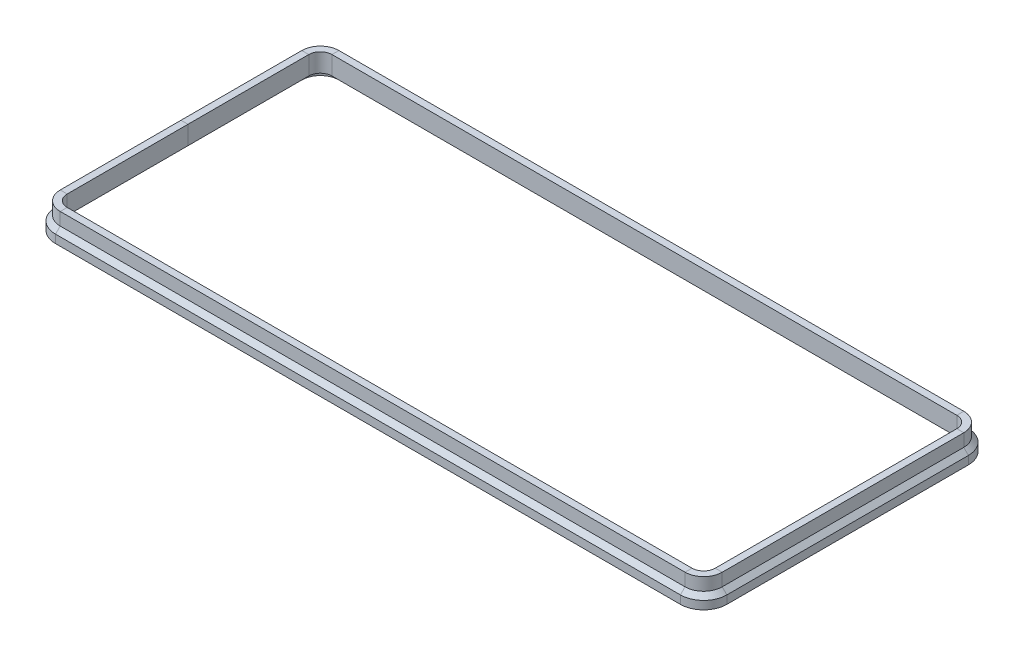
ISO-10303-21;
HEADER;
FILE_DESCRIPTION(('STEP AP214'),'2;1');
FILE_NAME('part.step','',(''),(''),'','','');
FILE_SCHEMA(('AUTOMOTIVE_DESIGN { 1 0 10303 214 1 1 1 1 }'));
ENDSEC;
DATA;
#1=APPLICATION_CONTEXT('core data for automotive mechanical design processes');
#2=APPLICATION_PROTOCOL_DEFINITION('international standard','automotive_design',2000,#1);
#3=PRODUCT_CONTEXT('',#1,'mechanical');
#4=PRODUCT('Part','Part','',(#3));
#5=PRODUCT_RELATED_PRODUCT_CATEGORY('part','',(#4));
#6=PRODUCT_DEFINITION_FORMATION('','',#4);
#7=PRODUCT_DEFINITION_CONTEXT('part definition',#1,'design');
#8=PRODUCT_DEFINITION('design','',#6,#7);
#9=PRODUCT_DEFINITION_SHAPE('','',#8);
#10=(LENGTH_UNIT() NAMED_UNIT(*) SI_UNIT(.MILLI.,.METRE.));
#11=(NAMED_UNIT(*) PLANE_ANGLE_UNIT() SI_UNIT($,.RADIAN.));
#12=(NAMED_UNIT(*) SI_UNIT($,.STERADIAN.) SOLID_ANGLE_UNIT());
#13=UNCERTAINTY_MEASURE_WITH_UNIT(LENGTH_MEASURE(1.E-05),#10,'distance_accuracy_value','');
#14=(GEOMETRIC_REPRESENTATION_CONTEXT(3) GLOBAL_UNCERTAINTY_ASSIGNED_CONTEXT((#13)) GLOBAL_UNIT_ASSIGNED_CONTEXT((#10,
#11,#12)) REPRESENTATION_CONTEXT('',''));
#15=CARTESIAN_POINT('',(0.,0.,0.));
#16=DIRECTION('',(0.,0.,1.));
#17=DIRECTION('',(1.,0.,0.));
#18=AXIS2_PLACEMENT_3D('',#15,#16,#17);
#19=CARTESIAN_POINT('',(-142.5,-3.,52.));
#20=DIRECTION('',(-1.,0.,0.));
#21=DIRECTION('',(0.,0.,1.));
#22=AXIS2_PLACEMENT_3D('',#19,#20,#21);
#23=PLANE('',#22);
#24=DIRECTION('',(0.,1.,0.));
#25=VECTOR('',#24,1.);
#26=CARTESIAN_POINT('',(-142.5,-3.,51.9999999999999));
#27=LINE('',#26,#25);
#28=CARTESIAN_POINT('',(-142.5,-3.,51.9999999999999));
#29=VERTEX_POINT('',#28);
#30=CARTESIAN_POINT('',(-142.5,0.,51.9999999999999));
#31=VERTEX_POINT('',#30);
#32=EDGE_CURVE('E388',#29,#31,#27,.T.);
#33=ORIENTED_EDGE('',*,*,#32,.F.);
#34=DIRECTION('',(0.,0.,-1.));
#35=VECTOR('',#34,1.);
#36=CARTESIAN_POINT('',(-142.5,-3.,52.));
#37=LINE('',#36,#35);
#38=CARTESIAN_POINT('',(-142.5,-3.,0.));
#39=VERTEX_POINT('',#38);
#40=EDGE_CURVE('E387',#29,#39,#37,.T.);
#41=ORIENTED_EDGE('',*,*,#40,.T.);
#42=DIRECTION('',(0.,1.,0.));
#43=VECTOR('',#42,1.);
#44=CARTESIAN_POINT('',(-142.5,-3.,0.));
#45=LINE('',#44,#43);
#46=CARTESIAN_POINT('',(-142.5,0.,0.));
#47=VERTEX_POINT('',#46);
#48=EDGE_CURVE('E362',#39,#47,#45,.T.);
#49=ORIENTED_EDGE('',*,*,#48,.T.);
#50=DIRECTION('',(0.,0.,-1.));
#51=VECTOR('',#50,1.);
#52=CARTESIAN_POINT('',(-142.5,0.,52.));
#53=LINE('',#52,#51);
#54=EDGE_CURVE('E392',#31,#47,#53,.T.);
#55=ORIENTED_EDGE('',*,*,#54,.F.);
#56=EDGE_LOOP('',(#33,#41,#49,#55));
#57=FACE_BOUND('',#56,.T.);
#58=ADVANCED_FACE('F34',(#57),#23,.F.);
#59=CARTESIAN_POINT('',(-142.5,-3.,0.));
#60=DIRECTION('',(-1.,0.,0.));
#61=DIRECTION('',(0.,0.,1.));
#62=AXIS2_PLACEMENT_3D('',#59,#60,#61);
#63=PLANE('',#62);
#64=DIRECTION('',(0.,0.,-1.));
#65=VECTOR('',#64,1.);
#66=CARTESIAN_POINT('',(-142.5,0.,0.));
#67=LINE('',#66,#65);
#68=CARTESIAN_POINT('',(-142.5,0.,-52.));
#69=VERTEX_POINT('',#68);
#70=EDGE_CURVE('E368',#47,#69,#67,.T.);
#71=ORIENTED_EDGE('',*,*,#70,.F.);
#72=ORIENTED_EDGE('',*,*,#48,.F.);
#73=DIRECTION('',(0.,0.,-1.));
#74=VECTOR('',#73,1.);
#75=CARTESIAN_POINT('',(-142.5,-3.,0.));
#76=LINE('',#75,#74);
#77=CARTESIAN_POINT('',(-142.5,-3.,-52.));
#78=VERTEX_POINT('',#77);
#79=EDGE_CURVE('E366',#39,#78,#76,.T.);
#80=ORIENTED_EDGE('',*,*,#79,.T.);
#81=DIRECTION('',(0.,1.,0.));
#82=VECTOR('',#81,1.);
#83=CARTESIAN_POINT('',(-142.5,-3.,-52.));
#84=LINE('',#83,#82);
#85=EDGE_CURVE('E384',#78,#69,#84,.T.);
#86=ORIENTED_EDGE('',*,*,#85,.T.);
#87=EDGE_LOOP('',(#71,#72,#80,#86));
#88=FACE_BOUND('',#87,.T.);
#89=ADVANCED_FACE('F364',(#88),#63,.F.);
#90=CARTESIAN_POINT('',(-142.5,0.,0.));
#91=DIRECTION('',(0.,1.,0.));
#92=DIRECTION('',(0.,0.,1.));
#93=AXIS2_PLACEMENT_3D('',#90,#91,#92);
#94=PLANE('',#93);
#95=DIRECTION('',(0.,0.,-1.));
#96=VECTOR('',#95,1.);
#97=CARTESIAN_POINT('',(-139.5,0.,0.));
#98=LINE('',#97,#96);
#99=CARTESIAN_POINT('',(-139.5,0.,0.));
#100=VERTEX_POINT('',#99);
#101=CARTESIAN_POINT('',(-139.5,0.,-52.));
#102=VERTEX_POINT('',#101);
#103=EDGE_CURVE('E513',#100,#102,#98,.T.);
#104=ORIENTED_EDGE('',*,*,#103,.F.);
#105=DIRECTION('',(1.,0.,0.));
#106=VECTOR('',#105,1.);
#107=CARTESIAN_POINT('',(-142.5,0.,0.));
#108=LINE('',#107,#106);
#109=EDGE_CURVE('E373',#47,#100,#108,.T.);
#110=ORIENTED_EDGE('',*,*,#109,.F.);
#111=ORIENTED_EDGE('',*,*,#70,.T.);
#112=DIRECTION('',(1.,0.,0.));
#113=VECTOR('',#112,1.);
#114=CARTESIAN_POINT('',(-142.5,0.,-52.));
#115=LINE('',#114,#113);
#116=EDGE_CURVE('E510',#69,#102,#115,.T.);
#117=ORIENTED_EDGE('',*,*,#116,.T.);
#118=EDGE_LOOP('',(#104,#110,#111,#117));
#119=FACE_BOUND('',#118,.T.);
#120=ADVANCED_FACE('F803',(#119),#94,.F.);
#121=CARTESIAN_POINT('',(-139.5,0.,0.));
#122=DIRECTION('',(-1.,0.,0.));
#123=DIRECTION('',(0.,0.,1.));
#124=AXIS2_PLACEMENT_3D('',#121,#122,#123);
#125=PLANE('',#124);
#126=DIRECTION('',(0.,0.,-1.));
#127=VECTOR('',#126,1.);
#128=CARTESIAN_POINT('',(-139.5,8.,0.));
#129=LINE('',#128,#127);
#130=CARTESIAN_POINT('',(-139.5,8.,0.));
#131=VERTEX_POINT('',#130);
#132=CARTESIAN_POINT('',(-139.5,8.,-52.));
#133=VERTEX_POINT('',#132);
#134=EDGE_CURVE('E562',#131,#133,#129,.T.);
#135=ORIENTED_EDGE('',*,*,#134,.F.);
#136=DIRECTION('',(0.,1.,0.));
#137=VECTOR('',#136,1.);
#138=CARTESIAN_POINT('',(-139.5,0.,0.));
#139=LINE('',#138,#137);
#140=EDGE_CURVE('E509',#100,#131,#139,.T.);
#141=ORIENTED_EDGE('',*,*,#140,.F.);
#142=ORIENTED_EDGE('',*,*,#103,.T.);
#143=DIRECTION('',(0.,1.,0.));
#144=VECTOR('',#143,1.);
#145=CARTESIAN_POINT('',(-139.5,0.,-52.));
#146=LINE('',#145,#144);
#147=EDGE_CURVE('E515',#102,#133,#146,.T.);
#148=ORIENTED_EDGE('',*,*,#147,.T.);
#149=EDGE_LOOP('',(#135,#141,#142,#148));
#150=FACE_BOUND('',#149,.T.);
#151=ADVANCED_FACE('F811',(#150),#125,.F.);
#152=CARTESIAN_POINT('',(-139.5,8.,0.));
#153=DIRECTION('',(0.,-1.,0.));
#154=DIRECTION('',(0.,0.,-1.));
#155=AXIS2_PLACEMENT_3D('',#152,#153,#154);
#156=PLANE('',#155);
#157=DIRECTION('',(0.,0.,-1.));
#158=VECTOR('',#157,1.);
#159=CARTESIAN_POINT('',(-142.5,8.,0.));
#160=LINE('',#159,#158);
#161=CARTESIAN_POINT('',(-142.5,8.,0.));
#162=VERTEX_POINT('',#161);
#163=CARTESIAN_POINT('',(-142.5,8.,-52.));
#164=VERTEX_POINT('',#163);
#165=EDGE_CURVE('E601',#162,#164,#160,.T.);
#166=ORIENTED_EDGE('',*,*,#165,.F.);
#167=DIRECTION('',(-1.,0.,0.));
#168=VECTOR('',#167,1.);
#169=CARTESIAN_POINT('',(-139.5,8.,0.));
#170=LINE('',#169,#168);
#171=EDGE_CURVE('E559',#131,#162,#170,.T.);
#172=ORIENTED_EDGE('',*,*,#171,.F.);
#173=ORIENTED_EDGE('',*,*,#134,.T.);
#174=DIRECTION('',(-1.,0.,0.));
#175=VECTOR('',#174,1.);
#176=CARTESIAN_POINT('',(-139.5,8.,-52.));
#177=LINE('',#176,#175);
#178=EDGE_CURVE('E564',#133,#164,#177,.T.);
#179=ORIENTED_EDGE('',*,*,#178,.T.);
#180=EDGE_LOOP('',(#166,#172,#173,#179));
#181=FACE_BOUND('',#180,.T.);
#182=ADVANCED_FACE('F850',(#181),#156,.F.);
#183=CARTESIAN_POINT('',(-142.5,8.,0.));
#184=DIRECTION('',(1.,0.,0.));
#185=DIRECTION('',(0.,0.,-1.));
#186=AXIS2_PLACEMENT_3D('',#183,#184,#185);
#187=PLANE('',#186);
#188=DIRECTION('',(0.,0.,-1.));
#189=VECTOR('',#188,1.);
#190=CARTESIAN_POINT('',(-142.5,2.53899454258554,0.));
#191=LINE('',#190,#189);
#192=CARTESIAN_POINT('',(-142.5,2.53899454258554,0.));
#193=VERTEX_POINT('',#192);
#194=CARTESIAN_POINT('',(-142.5,2.53899454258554,-52.));
#195=VERTEX_POINT('',#194);
#196=EDGE_CURVE('E639',#193,#195,#191,.T.);
#197=ORIENTED_EDGE('',*,*,#196,.F.);
#198=DIRECTION('',(0.,-1.,0.));
#199=VECTOR('',#198,1.);
#200=CARTESIAN_POINT('',(-142.5,8.,0.));
#201=LINE('',#200,#199);
#202=EDGE_CURVE('E598',#162,#193,#201,.T.);
#203=ORIENTED_EDGE('',*,*,#202,.F.);
#204=ORIENTED_EDGE('',*,*,#165,.T.);
#205=DIRECTION('',(0.,-1.,0.));
#206=VECTOR('',#205,1.);
#207=CARTESIAN_POINT('',(-142.5,8.,-52.));
#208=LINE('',#207,#206);
#209=EDGE_CURVE('E603',#164,#195,#208,.T.);
#210=ORIENTED_EDGE('',*,*,#209,.T.);
#211=EDGE_LOOP('',(#197,#203,#204,#210));
#212=FACE_BOUND('',#211,.T.);
#213=ADVANCED_FACE('F882',(#212),#187,.F.);
#214=CARTESIAN_POINT('',(-142.5,2.53899454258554,0.));
#215=DIRECTION('',(0.707106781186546,-0.707106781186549,0.));
#216=DIRECTION('',(0.707106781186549,0.707106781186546,0.));
#217=AXIS2_PLACEMENT_3D('',#214,#215,#216);
#218=PLANE('',#217);
#219=DIRECTION('',(0.,0.,-1.));
#220=VECTOR('',#219,1.);
#221=CARTESIAN_POINT('',(-144.5,0.538994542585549,0.));
#222=LINE('',#221,#220);
#223=CARTESIAN_POINT('',(-144.5,0.538994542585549,0.));
#224=VERTEX_POINT('',#223);
#225=CARTESIAN_POINT('',(-144.5,0.538994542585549,-52.));
#226=VERTEX_POINT('',#225);
#227=EDGE_CURVE('E450',#224,#226,#222,.T.);
#228=ORIENTED_EDGE('',*,*,#227,.F.);
#229=DIRECTION('',(-0.707106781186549,-0.707106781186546,0.));
#230=VECTOR('',#229,1.);
#231=CARTESIAN_POINT('',(-142.5,2.53899454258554,0.));
#232=LINE('',#231,#230);
#233=EDGE_CURVE('E398',#193,#224,#232,.T.);
#234=ORIENTED_EDGE('',*,*,#233,.F.);
#235=ORIENTED_EDGE('',*,*,#196,.T.);
#236=DIRECTION('',(-0.707106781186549,-0.707106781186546,0.));
#237=VECTOR('',#236,1.);
#238=CARTESIAN_POINT('',(-142.5,2.53899454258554,-52.));
#239=LINE('',#238,#237);
#240=EDGE_CURVE('E641',#195,#226,#239,.T.);
#241=ORIENTED_EDGE('',*,*,#240,.T.);
#242=EDGE_LOOP('',(#228,#234,#235,#241));
#243=FACE_BOUND('',#242,.T.);
#244=ADVANCED_FACE('F708',(#243),#218,.F.);
#245=CARTESIAN_POINT('',(-144.5,0.538994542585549,0.));
#246=DIRECTION('',(1.,0.,0.));
#247=DIRECTION('',(0.,0.,-1.));
#248=AXIS2_PLACEMENT_3D('',#245,#246,#247);
#249=PLANE('',#248);
#250=DIRECTION('',(0.,0.,-1.));
#251=VECTOR('',#250,1.);
#252=CARTESIAN_POINT('',(-144.5,-3.,0.));
#253=LINE('',#252,#251);
#254=CARTESIAN_POINT('',(-144.5,-3.,0.));
#255=VERTEX_POINT('',#254);
#256=CARTESIAN_POINT('',(-144.5,-3.,-52.));
#257=VERTEX_POINT('',#256);
#258=EDGE_CURVE('E404',#255,#257,#253,.T.);
#259=ORIENTED_EDGE('',*,*,#258,.F.);
#260=DIRECTION('',(0.,-1.,0.));
#261=VECTOR('',#260,1.);
#262=CARTESIAN_POINT('',(-144.5,0.538994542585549,0.));
#263=LINE('',#262,#261);
#264=EDGE_CURVE('E395',#224,#255,#263,.T.);
#265=ORIENTED_EDGE('',*,*,#264,.F.);
#266=ORIENTED_EDGE('',*,*,#227,.T.);
#267=DIRECTION('',(0.,-1.,0.));
#268=VECTOR('',#267,1.);
#269=CARTESIAN_POINT('',(-144.5,0.538994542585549,-52.));
#270=LINE('',#269,#268);
#271=EDGE_CURVE('E453',#226,#257,#270,.T.);
#272=ORIENTED_EDGE('',*,*,#271,.T.);
#273=EDGE_LOOP('',(#259,#265,#266,#272));
#274=FACE_BOUND('',#273,.T.);
#275=ADVANCED_FACE('F448',(#274),#249,.F.);
#276=CARTESIAN_POINT('',(-144.5,-3.,0.));
#277=DIRECTION('',(0.,1.,0.));
#278=DIRECTION('',(0.,0.,1.));
#279=AXIS2_PLACEMENT_3D('',#276,#277,#278);
#280=PLANE('',#279);
#281=DIRECTION('',(1.,0.,0.));
#282=VECTOR('',#281,1.);
#283=CARTESIAN_POINT('',(-144.5,-3.,-52.));
#284=LINE('',#283,#282);
#285=EDGE_CURVE('E382',#257,#78,#284,.T.);
#286=ORIENTED_EDGE('',*,*,#285,.T.);
#287=ORIENTED_EDGE('',*,*,#79,.F.);
#288=DIRECTION('',(1.,0.,0.));
#289=VECTOR('',#288,1.);
#290=CARTESIAN_POINT('',(-144.5,-3.,0.));
#291=LINE('',#290,#289);
#292=EDGE_CURVE('E380',#255,#39,#291,.T.);
#293=ORIENTED_EDGE('',*,*,#292,.F.);
#294=ORIENTED_EDGE('',*,*,#258,.T.);
#295=EDGE_LOOP('',(#286,#287,#293,#294));
#296=FACE_BOUND('',#295,.T.);
#297=ADVANCED_FACE('F378',(#296),#280,.F.);
#298=CARTESIAN_POINT('',(-134.5,0.,-52.));
#299=DIRECTION('',(0.,-1.,0.));
#300=DIRECTION('',(0.,0.,-1.));
#301=AXIS2_PLACEMENT_3D('',#298,#299,#300);
#302=CYLINDRICAL_SURFACE('',#301,8.00000000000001);
#303=CARTESIAN_POINT('',(-134.5,0.,-52.));
#304=DIRECTION('',(0.,-1.,0.));
#305=DIRECTION('',(-1.,0.,0.));
#306=AXIS2_PLACEMENT_3D('',#303,#304,#305);
#307=CIRCLE('',#306,8.00000000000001);
#308=CARTESIAN_POINT('',(-134.5,0.,-60.));
#309=VERTEX_POINT('',#308);
#310=EDGE_CURVE('E347',#69,#309,#307,.T.);
#311=ORIENTED_EDGE('',*,*,#310,.F.);
#312=ORIENTED_EDGE('',*,*,#85,.F.);
#313=CARTESIAN_POINT('',(-134.5,-3.,-52.));
#314=DIRECTION('',(0.,-1.,0.));
#315=DIRECTION('',(-1.,0.,0.));
#316=AXIS2_PLACEMENT_3D('',#313,#314,#315);
#317=CIRCLE('',#316,8.00000000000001);
#318=CARTESIAN_POINT('',(-134.5,-3.,-60.));
#319=VERTEX_POINT('',#318);
#320=EDGE_CURVE('E403',#78,#319,#317,.T.);
#321=ORIENTED_EDGE('',*,*,#320,.T.);
#322=DIRECTION('',(0.,1.,0.));
#323=VECTOR('',#322,1.);
#324=CARTESIAN_POINT('',(-134.5,-3.,-60.));
#325=LINE('',#324,#323);
#326=EDGE_CURVE('E725',#319,#309,#325,.T.);
#327=ORIENTED_EDGE('',*,*,#326,.T.);
#328=EDGE_LOOP('',(#311,#312,#321,#327));
#329=FACE_BOUND('',#328,.T.);
#330=ADVANCED_FACE('F817',(#329),#302,.F.);
#331=CARTESIAN_POINT('',(-142.5,0.,-52.));
#332=DIRECTION('',(0.,1.,0.));
#333=DIRECTION('',(0.,0.,1.));
#334=AXIS2_PLACEMENT_3D('',#331,#332,#333);
#335=PLANE('',#334);
#336=CARTESIAN_POINT('',(-134.5,0.,-52.));
#337=DIRECTION('',(0.,-1.,0.));
#338=DIRECTION('',(-1.,0.,0.));
#339=AXIS2_PLACEMENT_3D('',#336,#337,#338);
#340=CIRCLE('',#339,5.);
#341=CARTESIAN_POINT('',(-134.5,0.,-57.));
#342=VERTEX_POINT('',#341);
#343=EDGE_CURVE('E341',#102,#342,#340,.T.);
#344=ORIENTED_EDGE('',*,*,#343,.F.);
#345=ORIENTED_EDGE('',*,*,#116,.F.);
#346=ORIENTED_EDGE('',*,*,#310,.T.);
#347=DIRECTION('',(0.,0.,1.));
#348=VECTOR('',#347,1.);
#349=CARTESIAN_POINT('',(-134.5,0.,-60.));
#350=LINE('',#349,#348);
#351=EDGE_CURVE('E516',#309,#342,#350,.T.);
#352=ORIENTED_EDGE('',*,*,#351,.T.);
#353=EDGE_LOOP('',(#344,#345,#346,#352));
#354=FACE_BOUND('',#353,.T.);
#355=ADVANCED_FACE('F813',(#354),#335,.F.);
#356=CARTESIAN_POINT('',(-134.5,0.,-52.));
#357=DIRECTION('',(0.,-1.,0.));
#358=DIRECTION('',(0.,0.,-1.));
#359=AXIS2_PLACEMENT_3D('',#356,#357,#358);
#360=CYLINDRICAL_SURFACE('',#359,5.);
#361=CARTESIAN_POINT('',(-134.5,8.,-52.));
#362=DIRECTION('',(0.,-1.,0.));
#363=DIRECTION('',(-1.,0.,0.));
#364=AXIS2_PLACEMENT_3D('',#361,#362,#363);
#365=CIRCLE('',#364,5.);
#366=CARTESIAN_POINT('',(-134.5,8.,-57.));
#367=VERTEX_POINT('',#366);
#368=EDGE_CURVE('E566',#133,#367,#365,.T.);
#369=ORIENTED_EDGE('',*,*,#368,.F.);
#370=ORIENTED_EDGE('',*,*,#147,.F.);
#371=ORIENTED_EDGE('',*,*,#343,.T.);
#372=DIRECTION('',(0.,1.,0.));
#373=VECTOR('',#372,1.);
#374=CARTESIAN_POINT('',(-134.5,0.,-57.));
#375=LINE('',#374,#373);
#376=EDGE_CURVE('E519',#342,#367,#375,.T.);
#377=ORIENTED_EDGE('',*,*,#376,.T.);
#378=EDGE_LOOP('',(#369,#370,#371,#377));
#379=FACE_BOUND('',#378,.T.);
#380=ADVANCED_FACE('F816',(#379),#360,.F.);
#381=CARTESIAN_POINT('',(-139.5,8.,-52.));
#382=DIRECTION('',(0.,-1.,0.));
#383=DIRECTION('',(0.,0.,-1.));
#384=AXIS2_PLACEMENT_3D('',#381,#382,#383);
#385=PLANE('',#384);
#386=CARTESIAN_POINT('',(-134.5,8.,-52.));
#387=DIRECTION('',(0.,-1.,0.));
#388=DIRECTION('',(-1.,0.,0.));
#389=AXIS2_PLACEMENT_3D('',#386,#387,#388);
#390=CIRCLE('',#389,8.00000000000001);
#391=CARTESIAN_POINT('',(-134.5,8.,-60.));
#392=VERTEX_POINT('',#391);
#393=EDGE_CURVE('E606',#164,#392,#390,.T.);
#394=ORIENTED_EDGE('',*,*,#393,.F.);
#395=ORIENTED_EDGE('',*,*,#178,.F.);
#396=ORIENTED_EDGE('',*,*,#368,.T.);
#397=DIRECTION('',(0.,0.,-1.));
#398=VECTOR('',#397,1.);
#399=CARTESIAN_POINT('',(-134.5,8.,-57.));
#400=LINE('',#399,#398);
#401=EDGE_CURVE('E568',#367,#392,#400,.T.);
#402=ORIENTED_EDGE('',*,*,#401,.T.);
#403=EDGE_LOOP('',(#394,#395,#396,#402));
#404=FACE_BOUND('',#403,.T.);
#405=ADVANCED_FACE('F854',(#404),#385,.F.);
#406=CARTESIAN_POINT('',(-134.5,0.,-52.));
#407=DIRECTION('',(0.,-1.,0.));
#408=DIRECTION('',(0.,0.,-1.));
#409=AXIS2_PLACEMENT_3D('',#406,#407,#408);
#410=CYLINDRICAL_SURFACE('',#409,8.00000000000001);
#411=CARTESIAN_POINT('',(-134.5,2.53899454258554,-52.));
#412=DIRECTION('',(0.,-1.,0.));
#413=DIRECTION('',(-1.,0.,0.));
#414=AXIS2_PLACEMENT_3D('',#411,#412,#413);
#415=CIRCLE('',#414,8.00000000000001);
#416=CARTESIAN_POINT('',(-134.5,2.53899454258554,-60.));
#417=VERTEX_POINT('',#416);
#418=EDGE_CURVE('E644',#195,#417,#415,.T.);
#419=ORIENTED_EDGE('',*,*,#418,.F.);
#420=ORIENTED_EDGE('',*,*,#209,.F.);
#421=ORIENTED_EDGE('',*,*,#393,.T.);
#422=DIRECTION('',(0.,-1.,0.));
#423=VECTOR('',#422,1.);
#424=CARTESIAN_POINT('',(-134.5,8.,-60.));
#425=LINE('',#424,#423);
#426=EDGE_CURVE('E608',#392,#417,#425,.T.);
#427=ORIENTED_EDGE('',*,*,#426,.T.);
#428=EDGE_LOOP('',(#419,#420,#421,#427));
#429=FACE_BOUND('',#428,.T.);
#430=ADVANCED_FACE('F886',(#429),#410,.T.);
#431=CARTESIAN_POINT('',(-134.5,2.53899454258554,-52.));
#432=DIRECTION('',(0.,-1.,0.));
#433=DIRECTION('',(0.,0.,-1.));
#434=AXIS2_PLACEMENT_3D('',#431,#432,#433);
#435=CONICAL_SURFACE('',#434,8.00000000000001,0.785398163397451);
#436=CARTESIAN_POINT('',(-134.5,0.538994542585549,-52.));
#437=DIRECTION('',(0.,-1.,0.));
#438=DIRECTION('',(-1.,0.,0.));
#439=AXIS2_PLACEMENT_3D('',#436,#437,#438);
#440=CIRCLE('',#439,10.);
#441=CARTESIAN_POINT('',(-134.5,0.538994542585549,-62.));
#442=VERTEX_POINT('',#441);
#443=EDGE_CURVE('E461',#226,#442,#440,.T.);
#444=ORIENTED_EDGE('',*,*,#443,.F.);
#445=ORIENTED_EDGE('',*,*,#240,.F.);
#446=ORIENTED_EDGE('',*,*,#418,.T.);
#447=DIRECTION('',(0.,-0.707106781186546,-0.707106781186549));
#448=VECTOR('',#447,1.);
#449=CARTESIAN_POINT('',(-134.5,2.53899454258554,-60.));
#450=LINE('',#449,#448);
#451=EDGE_CURVE('E646',#417,#442,#450,.T.);
#452=ORIENTED_EDGE('',*,*,#451,.T.);
#453=EDGE_LOOP('',(#444,#445,#446,#452));
#454=FACE_BOUND('',#453,.T.);
#455=ADVANCED_FACE('F712',(#454),#435,.T.);
#456=CARTESIAN_POINT('',(-134.5,0.,-52.));
#457=DIRECTION('',(0.,-1.,0.));
#458=DIRECTION('',(0.,0.,-1.));
#459=AXIS2_PLACEMENT_3D('',#456,#457,#458);
#460=CYLINDRICAL_SURFACE('',#459,10.);
#461=CARTESIAN_POINT('',(-134.5,-3.,-52.));
#462=DIRECTION('',(0.,-1.,0.));
#463=DIRECTION('',(-1.,0.,0.));
#464=AXIS2_PLACEMENT_3D('',#461,#462,#463);
#465=CIRCLE('',#464,10.);
#466=CARTESIAN_POINT('',(-134.5,-3.,-62.));
#467=VERTEX_POINT('',#466);
#468=EDGE_CURVE('E409',#257,#467,#465,.T.);
#469=ORIENTED_EDGE('',*,*,#468,.F.);
#470=ORIENTED_EDGE('',*,*,#271,.F.);
#471=ORIENTED_EDGE('',*,*,#443,.T.);
#472=DIRECTION('',(0.,-1.,0.));
#473=VECTOR('',#472,1.);
#474=CARTESIAN_POINT('',(-134.5,0.538994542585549,-62.));
#475=LINE('',#474,#473);
#476=EDGE_CURVE('E458',#442,#467,#475,.T.);
#477=ORIENTED_EDGE('',*,*,#476,.T.);
#478=EDGE_LOOP('',(#469,#470,#471,#477));
#479=FACE_BOUND('',#478,.T.);
#480=ADVANCED_FACE('F716',(#479),#460,.T.);
#481=CARTESIAN_POINT('',(-144.5,-3.,-52.));
#482=DIRECTION('',(0.,1.,0.));
#483=DIRECTION('',(0.,0.,1.));
#484=AXIS2_PLACEMENT_3D('',#481,#482,#483);
#485=PLANE('',#484);
#486=DIRECTION('',(0.,0.,1.));
#487=VECTOR('',#486,1.);
#488=CARTESIAN_POINT('',(-134.5,-3.,-62.));
#489=LINE('',#488,#487);
#490=EDGE_CURVE('E405',#467,#319,#489,.T.);
#491=ORIENTED_EDGE('',*,*,#490,.T.);
#492=ORIENTED_EDGE('',*,*,#320,.F.);
#493=ORIENTED_EDGE('',*,*,#285,.F.);
#494=ORIENTED_EDGE('',*,*,#468,.T.);
#495=EDGE_LOOP('',(#491,#492,#493,#494));
#496=FACE_BOUND('',#495,.T.);
#497=ADVANCED_FACE('F720',(#496),#485,.F.);
#498=CARTESIAN_POINT('',(-134.5,-3.,-60.));
#499=DIRECTION('',(0.,0.,-1.));
#500=DIRECTION('',(-1.,0.,0.));
#501=AXIS2_PLACEMENT_3D('',#498,#499,#500);
#502=PLANE('',#501);
#503=DIRECTION('',(1.,0.,0.));
#504=VECTOR('',#503,1.);
#505=CARTESIAN_POINT('',(-134.5,0.,-60.));
#506=LINE('',#505,#504);
#507=CARTESIAN_POINT('',(134.5,0.,-60.));
#508=VERTEX_POINT('',#507);
#509=EDGE_CURVE('E308',#309,#508,#506,.T.);
#510=ORIENTED_EDGE('',*,*,#509,.F.);
#511=ORIENTED_EDGE('',*,*,#326,.F.);
#512=DIRECTION('',(1.,0.,0.));
#513=VECTOR('',#512,1.);
#514=CARTESIAN_POINT('',(-134.5,-3.,-60.));
#515=LINE('',#514,#513);
#516=CARTESIAN_POINT('',(134.5,-3.,-60.));
#517=VERTEX_POINT('',#516);
#518=EDGE_CURVE('E408',#319,#517,#515,.T.);
#519=ORIENTED_EDGE('',*,*,#518,.T.);
#520=DIRECTION('',(0.,1.,0.));
#521=VECTOR('',#520,1.);
#522=CARTESIAN_POINT('',(134.5,-3.,-60.));
#523=LINE('',#522,#521);
#524=EDGE_CURVE('E730',#517,#508,#523,.T.);
#525=ORIENTED_EDGE('',*,*,#524,.T.);
#526=EDGE_LOOP('',(#510,#511,#519,#525));
#527=FACE_BOUND('',#526,.T.);
#528=ADVANCED_FACE('F822',(#527),#502,.F.);
#529=CARTESIAN_POINT('',(-134.5,0.,-60.));
#530=DIRECTION('',(0.,1.,0.));
#531=DIRECTION('',(0.,0.,1.));
#532=AXIS2_PLACEMENT_3D('',#529,#530,#531);
#533=PLANE('',#532);
#534=DIRECTION('',(1.,0.,0.));
#535=VECTOR('',#534,1.);
#536=CARTESIAN_POINT('',(-134.5,0.,-57.));
#537=LINE('',#536,#535);
#538=CARTESIAN_POINT('',(134.5,0.,-57.));
#539=VERTEX_POINT('',#538);
#540=EDGE_CURVE('E301',#342,#539,#537,.T.);
#541=ORIENTED_EDGE('',*,*,#540,.F.);
#542=ORIENTED_EDGE('',*,*,#351,.F.);
#543=ORIENTED_EDGE('',*,*,#509,.T.);
#544=DIRECTION('',(0.,0.,1.));
#545=VECTOR('',#544,1.);
#546=CARTESIAN_POINT('',(134.5,0.,-60.));
#547=LINE('',#546,#545);
#548=EDGE_CURVE('E520',#508,#539,#547,.T.);
#549=ORIENTED_EDGE('',*,*,#548,.T.);
#550=EDGE_LOOP('',(#541,#542,#543,#549));
#551=FACE_BOUND('',#550,.T.);
#552=ADVANCED_FACE('F818',(#551),#533,.F.);
#553=CARTESIAN_POINT('',(-134.5,0.,-57.));
#554=DIRECTION('',(0.,0.,-1.));
#555=DIRECTION('',(-1.,0.,0.));
#556=AXIS2_PLACEMENT_3D('',#553,#554,#555);
#557=PLANE('',#556);
#558=DIRECTION('',(1.,0.,0.));
#559=VECTOR('',#558,1.);
#560=CARTESIAN_POINT('',(-134.5,8.,-57.));
#561=LINE('',#560,#559);
#562=CARTESIAN_POINT('',(134.5,8.,-57.));
#563=VERTEX_POINT('',#562);
#564=EDGE_CURVE('E294',#367,#563,#561,.T.);
#565=ORIENTED_EDGE('',*,*,#564,.F.);
#566=ORIENTED_EDGE('',*,*,#376,.F.);
#567=ORIENTED_EDGE('',*,*,#540,.T.);
#568=DIRECTION('',(0.,1.,0.));
#569=VECTOR('',#568,1.);
#570=CARTESIAN_POINT('',(134.5,0.,-57.));
#571=LINE('',#570,#569);
#572=EDGE_CURVE('E523',#539,#563,#571,.T.);
#573=ORIENTED_EDGE('',*,*,#572,.T.);
#574=EDGE_LOOP('',(#565,#566,#567,#573));
#575=FACE_BOUND('',#574,.T.);
#576=ADVANCED_FACE('F821',(#575),#557,.F.);
#577=CARTESIAN_POINT('',(-134.5,8.,-57.));
#578=DIRECTION('',(0.,-1.,0.));
#579=DIRECTION('',(0.,0.,-1.));
#580=AXIS2_PLACEMENT_3D('',#577,#578,#579);
#581=PLANE('',#580);
#582=DIRECTION('',(1.,0.,0.));
#583=VECTOR('',#582,1.);
#584=CARTESIAN_POINT('',(-134.5,8.,-60.));
#585=LINE('',#584,#583);
#586=CARTESIAN_POINT('',(134.5,8.,-60.));
#587=VERTEX_POINT('',#586);
#588=EDGE_CURVE('E610',#392,#587,#585,.T.);
#589=ORIENTED_EDGE('',*,*,#588,.F.);
#590=ORIENTED_EDGE('',*,*,#401,.F.);
#591=ORIENTED_EDGE('',*,*,#564,.T.);
#592=DIRECTION('',(0.,0.,-1.));
#593=VECTOR('',#592,1.);
#594=CARTESIAN_POINT('',(134.5,8.,-57.));
#595=LINE('',#594,#593);
#596=EDGE_CURVE('E571',#563,#587,#595,.T.);
#597=ORIENTED_EDGE('',*,*,#596,.T.);
#598=EDGE_LOOP('',(#589,#590,#591,#597));
#599=FACE_BOUND('',#598,.T.);
#600=ADVANCED_FACE('F857',(#599),#581,.F.);
#601=CARTESIAN_POINT('',(-134.5,8.,-60.));
#602=DIRECTION('',(0.,0.,1.));
#603=DIRECTION('',(1.,0.,0.));
#604=AXIS2_PLACEMENT_3D('',#601,#602,#603);
#605=PLANE('',#604);
#606=DIRECTION('',(1.,0.,0.));
#607=VECTOR('',#606,1.);
#608=CARTESIAN_POINT('',(-134.5,2.53899454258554,-60.));
#609=LINE('',#608,#607);
#610=CARTESIAN_POINT('',(134.5,2.53899454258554,-60.));
#611=VERTEX_POINT('',#610);
#612=EDGE_CURVE('E649',#417,#611,#609,.T.);
#613=ORIENTED_EDGE('',*,*,#612,.F.);
#614=ORIENTED_EDGE('',*,*,#426,.F.);
#615=ORIENTED_EDGE('',*,*,#588,.T.);
#616=DIRECTION('',(0.,-1.,0.));
#617=VECTOR('',#616,1.);
#618=CARTESIAN_POINT('',(134.5,8.,-60.));
#619=LINE('',#618,#617);
#620=EDGE_CURVE('E612',#587,#611,#619,.T.);
#621=ORIENTED_EDGE('',*,*,#620,.T.);
#622=EDGE_LOOP('',(#613,#614,#615,#621));
#623=FACE_BOUND('',#622,.T.);
#624=ADVANCED_FACE('F890',(#623),#605,.F.);
#625=CARTESIAN_POINT('',(-134.5,2.53899454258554,-60.));
#626=DIRECTION('',(0.,-0.707106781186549,0.707106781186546));
#627=DIRECTION('',(0.,-0.707106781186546,-0.707106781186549));
#628=AXIS2_PLACEMENT_3D('',#625,#626,#627);
#629=PLANE('',#628);
#630=DIRECTION('',(1.,0.,0.));
#631=VECTOR('',#630,1.);
#632=CARTESIAN_POINT('',(-134.5,0.538994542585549,-62.));
#633=LINE('',#632,#631);
#634=CARTESIAN_POINT('',(134.5,0.538994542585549,-62.));
#635=VERTEX_POINT('',#634);
#636=EDGE_CURVE('E466',#442,#635,#633,.T.);
#637=ORIENTED_EDGE('',*,*,#636,.F.);
#638=ORIENTED_EDGE('',*,*,#451,.F.);
#639=ORIENTED_EDGE('',*,*,#612,.T.);
#640=DIRECTION('',(0.,-0.707106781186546,-0.707106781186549));
#641=VECTOR('',#640,1.);
#642=CARTESIAN_POINT('',(134.5,2.53899454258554,-60.));
#643=LINE('',#642,#641);
#644=EDGE_CURVE('E651',#611,#635,#643,.T.);
#645=ORIENTED_EDGE('',*,*,#644,.T.);
#646=EDGE_LOOP('',(#637,#638,#639,#645));
#647=FACE_BOUND('',#646,.T.);
#648=ADVANCED_FACE('F918',(#647),#629,.F.);
#649=CARTESIAN_POINT('',(-134.5,0.538994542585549,-62.));
#650=DIRECTION('',(0.,0.,1.));
#651=DIRECTION('',(1.,0.,0.));
#652=AXIS2_PLACEMENT_3D('',#649,#650,#651);
#653=PLANE('',#652);
#654=DIRECTION('',(1.,0.,0.));
#655=VECTOR('',#654,1.);
#656=CARTESIAN_POINT('',(-134.5,-3.,-62.));
#657=LINE('',#656,#655);
#658=CARTESIAN_POINT('',(134.5,-3.,-62.));
#659=VERTEX_POINT('',#658);
#660=EDGE_CURVE('E414',#467,#659,#657,.T.);
#661=ORIENTED_EDGE('',*,*,#660,.F.);
#662=ORIENTED_EDGE('',*,*,#476,.F.);
#663=ORIENTED_EDGE('',*,*,#636,.T.);
#664=DIRECTION('',(0.,-1.,0.));
#665=VECTOR('',#664,1.);
#666=CARTESIAN_POINT('',(134.5,0.538994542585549,-62.));
#667=LINE('',#666,#665);
#668=EDGE_CURVE('E463',#635,#659,#667,.T.);
#669=ORIENTED_EDGE('',*,*,#668,.T.);
#670=EDGE_LOOP('',(#661,#662,#663,#669));
#671=FACE_BOUND('',#670,.T.);
#672=ADVANCED_FACE('F938',(#671),#653,.F.);
#673=CARTESIAN_POINT('',(-134.5,-3.,-62.));
#674=DIRECTION('',(0.,1.,0.));
#675=DIRECTION('',(0.,0.,1.));
#676=AXIS2_PLACEMENT_3D('',#673,#674,#675);
#677=PLANE('',#676);
#678=DIRECTION('',(0.,0.,1.));
#679=VECTOR('',#678,1.);
#680=CARTESIAN_POINT('',(134.5,-3.,-62.));
#681=LINE('',#680,#679);
#682=EDGE_CURVE('E410',#659,#517,#681,.T.);
#683=ORIENTED_EDGE('',*,*,#682,.T.);
#684=ORIENTED_EDGE('',*,*,#518,.F.);
#685=ORIENTED_EDGE('',*,*,#490,.F.);
#686=ORIENTED_EDGE('',*,*,#660,.T.);
#687=EDGE_LOOP('',(#683,#684,#685,#686));
#688=FACE_BOUND('',#687,.T.);
#689=ADVANCED_FACE('F966',(#688),#677,.F.);
#690=CARTESIAN_POINT('',(134.5,0.,-52.));
#691=DIRECTION('',(0.,-1.,0.));
#692=DIRECTION('',(0.,0.,-1.));
#693=AXIS2_PLACEMENT_3D('',#690,#691,#692);
#694=CYLINDRICAL_SURFACE('',#693,8.);
#695=CARTESIAN_POINT('',(134.5,0.,-52.));
#696=DIRECTION('',(0.,-1.,0.));
#697=DIRECTION('',(0.,0.,-1.));
#698=AXIS2_PLACEMENT_3D('',#695,#696,#697);
#699=CIRCLE('',#698,8.);
#700=CARTESIAN_POINT('',(142.5,0.,-52.));
#701=VERTEX_POINT('',#700);
#702=EDGE_CURVE('E526',#508,#701,#699,.T.);
#703=ORIENTED_EDGE('',*,*,#702,.F.);
#704=ORIENTED_EDGE('',*,*,#524,.F.);
#705=CARTESIAN_POINT('',(134.5,-3.,-52.));
#706=DIRECTION('',(0.,-1.,0.));
#707=DIRECTION('',(0.,0.,-1.));
#708=AXIS2_PLACEMENT_3D('',#705,#706,#707);
#709=CIRCLE('',#708,8.);
#710=CARTESIAN_POINT('',(142.5,-3.,-52.));
#711=VERTEX_POINT('',#710);
#712=EDGE_CURVE('E413',#517,#711,#709,.T.);
#713=ORIENTED_EDGE('',*,*,#712,.T.);
#714=DIRECTION('',(0.,1.,0.));
#715=VECTOR('',#714,1.);
#716=CARTESIAN_POINT('',(142.5,-3.,-52.));
#717=LINE('',#716,#715);
#718=EDGE_CURVE('E734',#711,#701,#717,.T.);
#719=ORIENTED_EDGE('',*,*,#718,.T.);
#720=EDGE_LOOP('',(#703,#704,#713,#719));
#721=FACE_BOUND('',#720,.T.);
#722=ADVANCED_FACE('F827',(#721),#694,.F.);
#723=CARTESIAN_POINT('',(134.5,0.,-60.));
#724=DIRECTION('',(0.,1.,0.));
#725=DIRECTION('',(0.,0.,1.));
#726=AXIS2_PLACEMENT_3D('',#723,#724,#725);
#727=PLANE('',#726);
#728=CARTESIAN_POINT('',(134.5,0.,-52.));
#729=DIRECTION('',(0.,-1.,0.));
#730=DIRECTION('',(0.,0.,-1.));
#731=AXIS2_PLACEMENT_3D('',#728,#729,#730);
#732=CIRCLE('',#731,5.);
#733=CARTESIAN_POINT('',(139.5,0.,-52.));
#734=VERTEX_POINT('',#733);
#735=EDGE_CURVE('E265',#539,#734,#732,.T.);
#736=ORIENTED_EDGE('',*,*,#735,.F.);
#737=ORIENTED_EDGE('',*,*,#548,.F.);
#738=ORIENTED_EDGE('',*,*,#702,.T.);
#739=DIRECTION('',(-1.,0.,0.));
#740=VECTOR('',#739,1.);
#741=CARTESIAN_POINT('',(142.5,0.,-52.));
#742=LINE('',#741,#740);
#743=EDGE_CURVE('E524',#701,#734,#742,.T.);
#744=ORIENTED_EDGE('',*,*,#743,.T.);
#745=EDGE_LOOP('',(#736,#737,#738,#744));
#746=FACE_BOUND('',#745,.T.);
#747=ADVANCED_FACE('F823',(#746),#727,.F.);
#748=CARTESIAN_POINT('',(134.5,0.,-52.));
#749=DIRECTION('',(0.,-1.,0.));
#750=DIRECTION('',(0.,0.,-1.));
#751=AXIS2_PLACEMENT_3D('',#748,#749,#750);
#752=CYLINDRICAL_SURFACE('',#751,5.);
#753=CARTESIAN_POINT('',(134.5,8.,-52.));
#754=DIRECTION('',(0.,-1.,0.));
#755=DIRECTION('',(0.,0.,-1.));
#756=AXIS2_PLACEMENT_3D('',#753,#754,#755);
#757=CIRCLE('',#756,5.);
#758=CARTESIAN_POINT('',(139.5,8.,-52.));
#759=VERTEX_POINT('',#758);
#760=EDGE_CURVE('E257',#563,#759,#757,.T.);
#761=ORIENTED_EDGE('',*,*,#760,.F.);
#762=ORIENTED_EDGE('',*,*,#572,.F.);
#763=ORIENTED_EDGE('',*,*,#735,.T.);
#764=DIRECTION('',(0.,1.,0.));
#765=VECTOR('',#764,1.);
#766=CARTESIAN_POINT('',(139.5,0.,-52.));
#767=LINE('',#766,#765);
#768=EDGE_CURVE('E528',#734,#759,#767,.T.);
#769=ORIENTED_EDGE('',*,*,#768,.T.);
#770=EDGE_LOOP('',(#761,#762,#763,#769));
#771=FACE_BOUND('',#770,.T.);
#772=ADVANCED_FACE('F826',(#771),#752,.F.);
#773=CARTESIAN_POINT('',(134.5,8.,-57.));
#774=DIRECTION('',(0.,-1.,0.));
#775=DIRECTION('',(0.,0.,-1.));
#776=AXIS2_PLACEMENT_3D('',#773,#774,#775);
#777=PLANE('',#776);
#778=CARTESIAN_POINT('',(134.5,8.,-52.));
#779=DIRECTION('',(0.,-1.,0.));
#780=DIRECTION('',(0.,0.,-1.));
#781=AXIS2_PLACEMENT_3D('',#778,#779,#780);
#782=CIRCLE('',#781,8.);
#783=CARTESIAN_POINT('',(142.5,8.,-52.));
#784=VERTEX_POINT('',#783);
#785=EDGE_CURVE('E250',#587,#784,#782,.T.);
#786=ORIENTED_EDGE('',*,*,#785,.F.);
#787=ORIENTED_EDGE('',*,*,#596,.F.);
#788=ORIENTED_EDGE('',*,*,#760,.T.);
#789=DIRECTION('',(1.,0.,0.));
#790=VECTOR('',#789,1.);
#791=CARTESIAN_POINT('',(139.5,8.,-52.));
#792=LINE('',#791,#790);
#793=EDGE_CURVE('E574',#759,#784,#792,.T.);
#794=ORIENTED_EDGE('',*,*,#793,.T.);
#795=EDGE_LOOP('',(#786,#787,#788,#794));
#796=FACE_BOUND('',#795,.T.);
#797=ADVANCED_FACE('F860',(#796),#777,.F.);
#798=CARTESIAN_POINT('',(134.5,0.,-52.));
#799=DIRECTION('',(0.,-1.,0.));
#800=DIRECTION('',(0.,0.,-1.));
#801=AXIS2_PLACEMENT_3D('',#798,#799,#800);
#802=CYLINDRICAL_SURFACE('',#801,8.);
#803=CARTESIAN_POINT('',(134.5,2.53899454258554,-52.));
#804=DIRECTION('',(0.,-1.,0.));
#805=DIRECTION('',(0.,0.,-1.));
#806=AXIS2_PLACEMENT_3D('',#803,#804,#805);
#807=CIRCLE('',#806,8.);
#808=CARTESIAN_POINT('',(142.5,2.53899454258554,-52.));
#809=VERTEX_POINT('',#808);
#810=EDGE_CURVE('E653',#611,#809,#807,.T.);
#811=ORIENTED_EDGE('',*,*,#810,.F.);
#812=ORIENTED_EDGE('',*,*,#620,.F.);
#813=ORIENTED_EDGE('',*,*,#785,.T.);
#814=DIRECTION('',(0.,-1.,0.));
#815=VECTOR('',#814,1.);
#816=CARTESIAN_POINT('',(142.5,8.,-52.));
#817=LINE('',#816,#815);
#818=EDGE_CURVE('E615',#784,#809,#817,.T.);
#819=ORIENTED_EDGE('',*,*,#818,.T.);
#820=EDGE_LOOP('',(#811,#812,#813,#819));
#821=FACE_BOUND('',#820,.T.);
#822=ADVANCED_FACE('F893',(#821),#802,.T.);
#823=CARTESIAN_POINT('',(134.5,2.53899454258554,-52.));
#824=DIRECTION('',(0.,-1.,0.));
#825=DIRECTION('',(0.,0.,-1.));
#826=AXIS2_PLACEMENT_3D('',#823,#824,#825);
#827=CONICAL_SURFACE('',#826,8.,0.785398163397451);
#828=CARTESIAN_POINT('',(134.5,0.538994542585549,-52.));
#829=DIRECTION('',(0.,-1.,0.));
#830=DIRECTION('',(0.,0.,-1.));
#831=AXIS2_PLACEMENT_3D('',#828,#829,#830);
#832=CIRCLE('',#831,10.);
#833=CARTESIAN_POINT('',(144.5,0.538994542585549,-52.));
#834=VERTEX_POINT('',#833);
#835=EDGE_CURVE('E471',#635,#834,#832,.T.);
#836=ORIENTED_EDGE('',*,*,#835,.F.);
#837=ORIENTED_EDGE('',*,*,#644,.F.);
#838=ORIENTED_EDGE('',*,*,#810,.T.);
#839=DIRECTION('',(0.707106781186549,-0.707106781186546,0.));
#840=VECTOR('',#839,1.);
#841=CARTESIAN_POINT('',(142.5,2.53899454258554,-52.));
#842=LINE('',#841,#840);
#843=EDGE_CURVE('E655',#809,#834,#842,.T.);
#844=ORIENTED_EDGE('',*,*,#843,.T.);
#845=EDGE_LOOP('',(#836,#837,#838,#844));
#846=FACE_BOUND('',#845,.T.);
#847=ADVANCED_FACE('F922',(#846),#827,.T.);
#848=CARTESIAN_POINT('',(134.5,0.,-52.));
#849=DIRECTION('',(0.,-1.,0.));
#850=DIRECTION('',(0.,0.,-1.));
#851=AXIS2_PLACEMENT_3D('',#848,#849,#850);
#852=CYLINDRICAL_SURFACE('',#851,10.);
#853=CARTESIAN_POINT('',(134.5,-3.,-52.));
#854=DIRECTION('',(0.,-1.,0.));
#855=DIRECTION('',(0.,0.,-1.));
#856=AXIS2_PLACEMENT_3D('',#853,#854,#855);
#857=CIRCLE('',#856,10.);
#858=CARTESIAN_POINT('',(144.5,-3.,-52.));
#859=VERTEX_POINT('',#858);
#860=EDGE_CURVE('E419',#659,#859,#857,.T.);
#861=ORIENTED_EDGE('',*,*,#860,.F.);
#862=ORIENTED_EDGE('',*,*,#668,.F.);
#863=ORIENTED_EDGE('',*,*,#835,.T.);
#864=DIRECTION('',(0.,-1.,0.));
#865=VECTOR('',#864,1.);
#866=CARTESIAN_POINT('',(144.5,0.538994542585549,-52.));
#867=LINE('',#866,#865);
#868=EDGE_CURVE('E468',#834,#859,#867,.T.);
#869=ORIENTED_EDGE('',*,*,#868,.T.);
#870=EDGE_LOOP('',(#861,#862,#863,#869));
#871=FACE_BOUND('',#870,.T.);
#872=ADVANCED_FACE('F942',(#871),#852,.T.);
#873=CARTESIAN_POINT('',(134.5,-3.,-62.));
#874=DIRECTION('',(0.,1.,0.));
#875=DIRECTION('',(0.,0.,1.));
#876=AXIS2_PLACEMENT_3D('',#873,#874,#875);
#877=PLANE('',#876);
#878=DIRECTION('',(-1.,0.,0.));
#879=VECTOR('',#878,1.);
#880=CARTESIAN_POINT('',(144.5,-3.,-52.));
#881=LINE('',#880,#879);
#882=EDGE_CURVE('E415',#859,#711,#881,.T.);
#883=ORIENTED_EDGE('',*,*,#882,.T.);
#884=ORIENTED_EDGE('',*,*,#712,.F.);
#885=ORIENTED_EDGE('',*,*,#682,.F.);
#886=ORIENTED_EDGE('',*,*,#860,.T.);
#887=EDGE_LOOP('',(#883,#884,#885,#886));
#888=FACE_BOUND('',#887,.T.);
#889=ADVANCED_FACE('F970',(#888),#877,.F.);
#890=CARTESIAN_POINT('',(142.5,-3.,-52.));
#891=DIRECTION('',(1.,0.,0.));
#892=DIRECTION('',(0.,0.,-1.));
#893=AXIS2_PLACEMENT_3D('',#890,#891,#892);
#894=PLANE('',#893);
#895=DIRECTION('',(0.,0.,1.));
#896=VECTOR('',#895,1.);
#897=CARTESIAN_POINT('',(142.5,0.,-52.));
#898=LINE('',#897,#896);
#899=CARTESIAN_POINT('',(142.5,0.,52.));
#900=VERTEX_POINT('',#899);
#901=EDGE_CURVE('E535',#701,#900,#898,.T.);
#902=ORIENTED_EDGE('',*,*,#901,.F.);
#903=ORIENTED_EDGE('',*,*,#718,.F.);
#904=DIRECTION('',(0.,0.,1.));
#905=VECTOR('',#904,1.);
#906=CARTESIAN_POINT('',(142.5,-3.,-52.));
#907=LINE('',#906,#905);
#908=CARTESIAN_POINT('',(142.5,-3.,52.));
#909=VERTEX_POINT('',#908);
#910=EDGE_CURVE('E418',#711,#909,#907,.T.);
#911=ORIENTED_EDGE('',*,*,#910,.T.);
#912=DIRECTION('',(0.,1.,0.));
#913=VECTOR('',#912,1.);
#914=CARTESIAN_POINT('',(142.5,-3.,52.));
#915=LINE('',#914,#913);
#916=EDGE_CURVE('E478',#909,#900,#915,.T.);
#917=ORIENTED_EDGE('',*,*,#916,.T.);
#918=EDGE_LOOP('',(#902,#903,#911,#917));
#919=FACE_BOUND('',#918,.T.);
#920=ADVANCED_FACE('F772',(#919),#894,.F.);
#921=CARTESIAN_POINT('',(142.5,0.,-52.));
#922=DIRECTION('',(0.,1.,0.));
#923=DIRECTION('',(0.,0.,1.));
#924=AXIS2_PLACEMENT_3D('',#921,#922,#923);
#925=PLANE('',#924);
#926=DIRECTION('',(0.,0.,1.));
#927=VECTOR('',#926,1.);
#928=CARTESIAN_POINT('',(139.5,0.,-52.));
#929=LINE('',#928,#927);
#930=CARTESIAN_POINT('',(139.5,0.,52.));
#931=VERTEX_POINT('',#930);
#932=EDGE_CURVE('E533',#734,#931,#929,.T.);
#933=ORIENTED_EDGE('',*,*,#932,.F.);
#934=ORIENTED_EDGE('',*,*,#743,.F.);
#935=ORIENTED_EDGE('',*,*,#901,.T.);
#936=DIRECTION('',(-1.,0.,0.));
#937=VECTOR('',#936,1.);
#938=CARTESIAN_POINT('',(142.5,0.,52.));
#939=LINE('',#938,#937);
#940=EDGE_CURVE('E529',#900,#931,#939,.T.);
#941=ORIENTED_EDGE('',*,*,#940,.T.);
#942=EDGE_LOOP('',(#933,#934,#935,#941));
#943=FACE_BOUND('',#942,.T.);
#944=ADVANCED_FACE('F766',(#943),#925,.F.);
#945=CARTESIAN_POINT('',(139.5,0.,-52.));
#946=DIRECTION('',(1.,0.,0.));
#947=DIRECTION('',(0.,0.,-1.));
#948=AXIS2_PLACEMENT_3D('',#945,#946,#947);
#949=PLANE('',#948);
#950=DIRECTION('',(0.,0.,1.));
#951=VECTOR('',#950,1.);
#952=CARTESIAN_POINT('',(139.5,8.,-52.));
#953=LINE('',#952,#951);
#954=CARTESIAN_POINT('',(139.5,8.,52.));
#955=VERTEX_POINT('',#954);
#956=EDGE_CURVE('E219',#759,#955,#953,.T.);
#957=ORIENTED_EDGE('',*,*,#956,.F.);
#958=ORIENTED_EDGE('',*,*,#768,.F.);
#959=ORIENTED_EDGE('',*,*,#932,.T.);
#960=DIRECTION('',(0.,1.,0.));
#961=VECTOR('',#960,1.);
#962=CARTESIAN_POINT('',(139.5,0.,52.));
#963=LINE('',#962,#961);
#964=EDGE_CURVE('E532',#931,#955,#963,.T.);
#965=ORIENTED_EDGE('',*,*,#964,.T.);
#966=EDGE_LOOP('',(#957,#958,#959,#965));
#967=FACE_BOUND('',#966,.T.);
#968=ADVANCED_FACE('F831',(#967),#949,.F.);
#969=CARTESIAN_POINT('',(139.5,8.,-52.));
#970=DIRECTION('',(0.,-1.,0.));
#971=DIRECTION('',(0.,0.,-1.));
#972=AXIS2_PLACEMENT_3D('',#969,#970,#971);
#973=PLANE('',#972);
#974=DIRECTION('',(0.,0.,1.));
#975=VECTOR('',#974,1.);
#976=CARTESIAN_POINT('',(142.5,8.,-52.));
#977=LINE('',#976,#975);
#978=CARTESIAN_POINT('',(142.5,8.,52.));
#979=VERTEX_POINT('',#978);
#980=EDGE_CURVE('E211',#784,#979,#977,.T.);
#981=ORIENTED_EDGE('',*,*,#980,.F.);
#982=ORIENTED_EDGE('',*,*,#793,.F.);
#983=ORIENTED_EDGE('',*,*,#956,.T.);
#984=DIRECTION('',(1.,0.,0.));
#985=VECTOR('',#984,1.);
#986=CARTESIAN_POINT('',(139.5,8.,52.));
#987=LINE('',#986,#985);
#988=EDGE_CURVE('E576',#955,#979,#987,.T.);
#989=ORIENTED_EDGE('',*,*,#988,.T.);
#990=EDGE_LOOP('',(#981,#982,#983,#989));
#991=FACE_BOUND('',#990,.T.);
#992=ADVANCED_FACE('F863',(#991),#973,.F.);
#993=CARTESIAN_POINT('',(142.5,8.,-52.));
#994=DIRECTION('',(-1.,0.,0.));
#995=DIRECTION('',(0.,0.,1.));
#996=AXIS2_PLACEMENT_3D('',#993,#994,#995);
#997=PLANE('',#996);
#998=DIRECTION('',(0.,0.,1.));
#999=VECTOR('',#998,1.);
#1000=CARTESIAN_POINT('',(142.5,2.53899454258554,-52.));
#1001=LINE('',#1000,#999);
#1002=CARTESIAN_POINT('',(142.5,2.53899454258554,52.));
#1003=VERTEX_POINT('',#1002);
#1004=EDGE_CURVE('E204',#809,#1003,#1001,.T.);
#1005=ORIENTED_EDGE('',*,*,#1004,.F.);
#1006=ORIENTED_EDGE('',*,*,#818,.F.);
#1007=ORIENTED_EDGE('',*,*,#980,.T.);
#1008=DIRECTION('',(0.,-1.,0.));
#1009=VECTOR('',#1008,1.);
#1010=CARTESIAN_POINT('',(142.5,8.,52.));
#1011=LINE('',#1010,#1009);
#1012=EDGE_CURVE('E617',#979,#1003,#1011,.T.);
#1013=ORIENTED_EDGE('',*,*,#1012,.T.);
#1014=EDGE_LOOP('',(#1005,#1006,#1007,#1013));
#1015=FACE_BOUND('',#1014,.T.);
#1016=ADVANCED_FACE('F896',(#1015),#997,.F.);
#1017=CARTESIAN_POINT('',(142.5,2.53899454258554,-52.));
#1018=DIRECTION('',(-0.707106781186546,-0.707106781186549,0.));
#1019=DIRECTION('',(0.707106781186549,-0.707106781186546,0.));
#1020=AXIS2_PLACEMENT_3D('',#1017,#1018,#1019);
#1021=PLANE('',#1020);
#1022=DIRECTION('',(0.,0.,1.));
#1023=VECTOR('',#1022,1.);
#1024=CARTESIAN_POINT('',(144.5,0.538994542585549,-52.));
#1025=LINE('',#1024,#1023);
#1026=CARTESIAN_POINT('',(144.5,0.538994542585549,52.));
#1027=VERTEX_POINT('',#1026);
#1028=EDGE_CURVE('E479',#834,#1027,#1025,.T.);
#1029=ORIENTED_EDGE('',*,*,#1028,.F.);
#1030=ORIENTED_EDGE('',*,*,#843,.F.);
#1031=ORIENTED_EDGE('',*,*,#1004,.T.);
#1032=DIRECTION('',(0.707106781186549,-0.707106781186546,0.));
#1033=VECTOR('',#1032,1.);
#1034=CARTESIAN_POINT('',(142.5,2.53899454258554,52.));
#1035=LINE('',#1034,#1033);
#1036=EDGE_CURVE('E475',#1003,#1027,#1035,.T.);
#1037=ORIENTED_EDGE('',*,*,#1036,.T.);
#1038=EDGE_LOOP('',(#1029,#1030,#1031,#1037));
#1039=FACE_BOUND('',#1038,.T.);
#1040=ADVANCED_FACE('F782',(#1039),#1021,.F.);
#1041=CARTESIAN_POINT('',(144.5,0.538994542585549,-52.));
#1042=DIRECTION('',(-1.,0.,0.));
#1043=DIRECTION('',(0.,0.,1.));
#1044=AXIS2_PLACEMENT_3D('',#1041,#1042,#1043);
#1045=PLANE('',#1044);
#1046=DIRECTION('',(0.,0.,1.));
#1047=VECTOR('',#1046,1.);
#1048=CARTESIAN_POINT('',(144.5,-3.,-52.));
#1049=LINE('',#1048,#1047);
#1050=CARTESIAN_POINT('',(144.5,-3.,52.));
#1051=VERTEX_POINT('',#1050);
#1052=EDGE_CURVE('E476',#859,#1051,#1049,.T.);
#1053=ORIENTED_EDGE('',*,*,#1052,.F.);
#1054=ORIENTED_EDGE('',*,*,#868,.F.);
#1055=ORIENTED_EDGE('',*,*,#1028,.T.);
#1056=DIRECTION('',(0.,-1.,0.));
#1057=VECTOR('',#1056,1.);
#1058=CARTESIAN_POINT('',(144.5,0.538994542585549,52.));
#1059=LINE('',#1058,#1057);
#1060=EDGE_CURVE('E424',#1027,#1051,#1059,.T.);
#1061=ORIENTED_EDGE('',*,*,#1060,.T.);
#1062=EDGE_LOOP('',(#1053,#1054,#1055,#1061));
#1063=FACE_BOUND('',#1062,.T.);
#1064=ADVANCED_FACE('F780',(#1063),#1045,.F.);
#1065=CARTESIAN_POINT('',(144.5,-3.,-52.));
#1066=DIRECTION('',(0.,1.,0.));
#1067=DIRECTION('',(0.,0.,1.));
#1068=AXIS2_PLACEMENT_3D('',#1065,#1066,#1067);
#1069=PLANE('',#1068);
#1070=DIRECTION('',(-1.,0.,0.));
#1071=VECTOR('',#1070,1.);
#1072=CARTESIAN_POINT('',(144.5,-3.,52.));
#1073=LINE('',#1072,#1071);
#1074=EDGE_CURVE('E420',#1051,#909,#1073,.T.);
#1075=ORIENTED_EDGE('',*,*,#1074,.T.);
#1076=ORIENTED_EDGE('',*,*,#910,.F.);
#1077=ORIENTED_EDGE('',*,*,#882,.F.);
#1078=ORIENTED_EDGE('',*,*,#1052,.T.);
#1079=EDGE_LOOP('',(#1075,#1076,#1077,#1078));
#1080=FACE_BOUND('',#1079,.T.);
#1081=ADVANCED_FACE('F776',(#1080),#1069,.F.);
#1082=CARTESIAN_POINT('',(134.5,0.,52.));
#1083=DIRECTION('',(0.,-1.,0.));
#1084=DIRECTION('',(0.,0.,-1.));
#1085=AXIS2_PLACEMENT_3D('',#1082,#1083,#1084);
#1086=CYLINDRICAL_SURFACE('',#1085,7.99999999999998);
#1087=CARTESIAN_POINT('',(134.5,0.,52.));
#1088=DIRECTION('',(0.,-1.,0.));
#1089=DIRECTION('',(1.,0.,0.));
#1090=AXIS2_PLACEMENT_3D('',#1087,#1088,#1089);
#1091=CIRCLE('',#1090,7.99999999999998);
#1092=CARTESIAN_POINT('',(134.5,0.,60.));
#1093=VERTEX_POINT('',#1092);
#1094=EDGE_CURVE('E540',#900,#1093,#1091,.T.);
#1095=ORIENTED_EDGE('',*,*,#1094,.F.);
#1096=ORIENTED_EDGE('',*,*,#916,.F.);
#1097=CARTESIAN_POINT('',(134.5,-3.,52.));
#1098=DIRECTION('',(0.,-1.,0.));
#1099=DIRECTION('',(1.,0.,0.));
#1100=AXIS2_PLACEMENT_3D('',#1097,#1098,#1099);
#1101=CIRCLE('',#1100,7.99999999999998);
#1102=CARTESIAN_POINT('',(134.5,-3.,60.));
#1103=VERTEX_POINT('',#1102);
#1104=EDGE_CURVE('E423',#909,#1103,#1101,.T.);
#1105=ORIENTED_EDGE('',*,*,#1104,.T.);
#1106=DIRECTION('',(0.,1.,0.));
#1107=VECTOR('',#1106,1.);
#1108=CARTESIAN_POINT('',(134.5,-3.,60.));
#1109=LINE('',#1108,#1107);
#1110=EDGE_CURVE('E743',#1103,#1093,#1109,.T.);
#1111=ORIENTED_EDGE('',*,*,#1110,.T.);
#1112=EDGE_LOOP('',(#1095,#1096,#1105,#1111));
#1113=FACE_BOUND('',#1112,.T.);
#1114=ADVANCED_FACE('F750',(#1113),#1086,.F.);
#1115=CARTESIAN_POINT('',(142.5,0.,52.));
#1116=DIRECTION('',(0.,1.,0.));
#1117=DIRECTION('',(0.,0.,1.));
#1118=AXIS2_PLACEMENT_3D('',#1115,#1116,#1117);
#1119=PLANE('',#1118);
#1120=CARTESIAN_POINT('',(134.5,0.,52.));
#1121=DIRECTION('',(0.,-1.,0.));
#1122=DIRECTION('',(1.,0.,0.));
#1123=AXIS2_PLACEMENT_3D('',#1120,#1121,#1122);
#1124=CIRCLE('',#1123,4.99999999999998);
#1125=CARTESIAN_POINT('',(134.5,0.,57.));
#1126=VERTEX_POINT('',#1125);
#1127=EDGE_CURVE('E539',#931,#1126,#1124,.T.);
#1128=ORIENTED_EDGE('',*,*,#1127,.F.);
#1129=ORIENTED_EDGE('',*,*,#940,.F.);
#1130=ORIENTED_EDGE('',*,*,#1094,.T.);
#1131=DIRECTION('',(0.,0.,-1.));
#1132=VECTOR('',#1131,1.);
#1133=CARTESIAN_POINT('',(134.5,0.,60.));
#1134=LINE('',#1133,#1132);
#1135=EDGE_CURVE('E536',#1093,#1126,#1134,.T.);
#1136=ORIENTED_EDGE('',*,*,#1135,.T.);
#1137=EDGE_LOOP('',(#1128,#1129,#1130,#1136));
#1138=FACE_BOUND('',#1137,.T.);
#1139=ADVANCED_FACE('F761',(#1138),#1119,.F.);
#1140=CARTESIAN_POINT('',(134.5,0.,52.));
#1141=DIRECTION('',(0.,-1.,0.));
#1142=DIRECTION('',(0.,0.,-1.));
#1143=AXIS2_PLACEMENT_3D('',#1140,#1141,#1142);
#1144=CYLINDRICAL_SURFACE('',#1143,4.99999999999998);
#1145=CARTESIAN_POINT('',(134.5,8.,52.));
#1146=DIRECTION('',(0.,-1.,0.));
#1147=DIRECTION('',(1.,0.,0.));
#1148=AXIS2_PLACEMENT_3D('',#1145,#1146,#1147);
#1149=CIRCLE('',#1148,4.99999999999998);
#1150=CARTESIAN_POINT('',(134.5,8.,57.));
#1151=VERTEX_POINT('',#1150);
#1152=EDGE_CURVE('E580',#955,#1151,#1149,.T.);
#1153=ORIENTED_EDGE('',*,*,#1152,.F.);
#1154=ORIENTED_EDGE('',*,*,#964,.F.);
#1155=ORIENTED_EDGE('',*,*,#1127,.T.);
#1156=DIRECTION('',(0.,1.,0.));
#1157=VECTOR('',#1156,1.);
#1158=CARTESIAN_POINT('',(134.5,0.,57.));
#1159=LINE('',#1158,#1157);
#1160=EDGE_CURVE('E542',#1126,#1151,#1159,.T.);
#1161=ORIENTED_EDGE('',*,*,#1160,.T.);
#1162=EDGE_LOOP('',(#1153,#1154,#1155,#1161));
#1163=FACE_BOUND('',#1162,.T.);
#1164=ADVANCED_FACE('F834',(#1163),#1144,.F.);
#1165=CARTESIAN_POINT('',(139.5,8.,52.));
#1166=DIRECTION('',(0.,-1.,0.));
#1167=DIRECTION('',(0.,0.,-1.));
#1168=AXIS2_PLACEMENT_3D('',#1165,#1166,#1167);
#1169=PLANE('',#1168);
#1170=CARTESIAN_POINT('',(134.5,8.,52.));
#1171=DIRECTION('',(0.,-1.,0.));
#1172=DIRECTION('',(1.,0.,0.));
#1173=AXIS2_PLACEMENT_3D('',#1170,#1171,#1172);
#1174=CIRCLE('',#1173,7.99999999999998);
#1175=CARTESIAN_POINT('',(134.5,8.,60.));
#1176=VERTEX_POINT('',#1175);
#1177=EDGE_CURVE('E173',#979,#1176,#1174,.T.);
#1178=ORIENTED_EDGE('',*,*,#1177,.F.);
#1179=ORIENTED_EDGE('',*,*,#988,.F.);
#1180=ORIENTED_EDGE('',*,*,#1152,.T.);
#1181=DIRECTION('',(0.,0.,1.));
#1182=VECTOR('',#1181,1.);
#1183=CARTESIAN_POINT('',(134.5,8.,57.));
#1184=LINE('',#1183,#1182);
#1185=EDGE_CURVE('E582',#1151,#1176,#1184,.T.);
#1186=ORIENTED_EDGE('',*,*,#1185,.T.);
#1187=EDGE_LOOP('',(#1178,#1179,#1180,#1186));
#1188=FACE_BOUND('',#1187,.T.);
#1189=ADVANCED_FACE('F867',(#1188),#1169,.F.);
#1190=CARTESIAN_POINT('',(134.5,0.,52.));
#1191=DIRECTION('',(0.,-1.,0.));
#1192=DIRECTION('',(0.,0.,-1.));
#1193=AXIS2_PLACEMENT_3D('',#1190,#1191,#1192);
#1194=CYLINDRICAL_SURFACE('',#1193,7.99999999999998);
#1195=CARTESIAN_POINT('',(134.5,2.53899454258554,52.));
#1196=DIRECTION('',(0.,-1.,0.));
#1197=DIRECTION('',(1.,0.,0.));
#1198=AXIS2_PLACEMENT_3D('',#1195,#1196,#1197);
#1199=CIRCLE('',#1198,7.99999999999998);
#1200=CARTESIAN_POINT('',(134.5,2.53899454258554,60.));
#1201=VERTEX_POINT('',#1200);
#1202=EDGE_CURVE('E165',#1003,#1201,#1199,.T.);
#1203=ORIENTED_EDGE('',*,*,#1202,.F.);
#1204=ORIENTED_EDGE('',*,*,#1012,.F.);
#1205=ORIENTED_EDGE('',*,*,#1177,.T.);
#1206=DIRECTION('',(0.,-1.,0.));
#1207=VECTOR('',#1206,1.);
#1208=CARTESIAN_POINT('',(134.5,8.,60.));
#1209=LINE('',#1208,#1207);
#1210=EDGE_CURVE('E621',#1176,#1201,#1209,.T.);
#1211=ORIENTED_EDGE('',*,*,#1210,.T.);
#1212=EDGE_LOOP('',(#1203,#1204,#1205,#1211));
#1213=FACE_BOUND('',#1212,.T.);
#1214=ADVANCED_FACE('F899',(#1213),#1194,.T.);
#1215=CARTESIAN_POINT('',(134.5,2.53899454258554,52.));
#1216=DIRECTION('',(0.,-1.,0.));
#1217=DIRECTION('',(0.,0.,-1.));
#1218=AXIS2_PLACEMENT_3D('',#1215,#1216,#1217);
#1219=CONICAL_SURFACE('',#1218,7.99999999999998,0.785398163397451);
#1220=CARTESIAN_POINT('',(134.5,0.538994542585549,52.));
#1221=DIRECTION('',(0.,-1.,0.));
#1222=DIRECTION('',(1.,0.,0.));
#1223=AXIS2_PLACEMENT_3D('',#1220,#1221,#1222);
#1224=CIRCLE('',#1223,9.99999999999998);
#1225=CARTESIAN_POINT('',(134.5,0.538994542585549,62.));
#1226=VERTEX_POINT('',#1225);
#1227=EDGE_CURVE('E158',#1027,#1226,#1224,.T.);
#1228=ORIENTED_EDGE('',*,*,#1227,.F.);
#1229=ORIENTED_EDGE('',*,*,#1036,.F.);
#1230=ORIENTED_EDGE('',*,*,#1202,.T.);
#1231=DIRECTION('',(0.,-0.707106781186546,0.707106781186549));
#1232=VECTOR('',#1231,1.);
#1233=CARTESIAN_POINT('',(134.5,2.53899454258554,60.));
#1234=LINE('',#1233,#1232);
#1235=EDGE_CURVE('E660',#1201,#1226,#1234,.T.);
#1236=ORIENTED_EDGE('',*,*,#1235,.T.);
#1237=EDGE_LOOP('',(#1228,#1229,#1230,#1236));
#1238=FACE_BOUND('',#1237,.T.);
#1239=ADVANCED_FACE('F783',(#1238),#1219,.T.);
#1240=CARTESIAN_POINT('',(134.5,0.,52.));
#1241=DIRECTION('',(0.,-1.,0.));
#1242=DIRECTION('',(0.,0.,-1.));
#1243=AXIS2_PLACEMENT_3D('',#1240,#1241,#1242);
#1244=CYLINDRICAL_SURFACE('',#1243,9.99999999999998);
#1245=CARTESIAN_POINT('',(134.5,-3.,52.));
#1246=DIRECTION('',(0.,-1.,0.));
#1247=DIRECTION('',(1.,0.,0.));
#1248=AXIS2_PLACEMENT_3D('',#1245,#1246,#1247);
#1249=CIRCLE('',#1248,9.99999999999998);
#1250=CARTESIAN_POINT('',(134.5,-3.,62.));
#1251=VERTEX_POINT('',#1250);
#1252=EDGE_CURVE('E428',#1051,#1251,#1249,.T.);
#1253=ORIENTED_EDGE('',*,*,#1252,.F.);
#1254=ORIENTED_EDGE('',*,*,#1060,.F.);
#1255=ORIENTED_EDGE('',*,*,#1227,.T.);
#1256=DIRECTION('',(0.,-1.,0.));
#1257=VECTOR('',#1256,1.);
#1258=CARTESIAN_POINT('',(134.5,0.538994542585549,62.));
#1259=LINE('',#1258,#1257);
#1260=EDGE_CURVE('E480',#1226,#1251,#1259,.T.);
#1261=ORIENTED_EDGE('',*,*,#1260,.T.);
#1262=EDGE_LOOP('',(#1253,#1254,#1255,#1261));
#1263=FACE_BOUND('',#1262,.T.);
#1264=ADVANCED_FACE('F486',(#1263),#1244,.T.);
#1265=CARTESIAN_POINT('',(144.5,-3.,52.));
#1266=DIRECTION('',(0.,1.,0.));
#1267=DIRECTION('',(0.,0.,1.));
#1268=AXIS2_PLACEMENT_3D('',#1265,#1266,#1267);
#1269=PLANE('',#1268);
#1270=DIRECTION('',(0.,0.,-1.));
#1271=VECTOR('',#1270,1.);
#1272=CARTESIAN_POINT('',(134.5,-3.,62.));
#1273=LINE('',#1272,#1271);
#1274=EDGE_CURVE('E425',#1251,#1103,#1273,.T.);
#1275=ORIENTED_EDGE('',*,*,#1274,.T.);
#1276=ORIENTED_EDGE('',*,*,#1104,.F.);
#1277=ORIENTED_EDGE('',*,*,#1074,.F.);
#1278=ORIENTED_EDGE('',*,*,#1252,.T.);
#1279=EDGE_LOOP('',(#1275,#1276,#1277,#1278));
#1280=FACE_BOUND('',#1279,.T.);
#1281=ADVANCED_FACE('F484',(#1280),#1269,.F.);
#1282=CARTESIAN_POINT('',(134.5,-3.,60.));
#1283=DIRECTION('',(0.,0.,1.));
#1284=DIRECTION('',(1.,0.,0.));
#1285=AXIS2_PLACEMENT_3D('',#1282,#1283,#1284);
#1286=PLANE('',#1285);
#1287=DIRECTION('',(-1.,0.,0.));
#1288=VECTOR('',#1287,1.);
#1289=CARTESIAN_POINT('',(134.5,0.,60.));
#1290=LINE('',#1289,#1288);
#1291=CARTESIAN_POINT('',(-134.5,0.,60.));
#1292=VERTEX_POINT('',#1291);
#1293=EDGE_CURVE('E495',#1093,#1292,#1290,.T.);
#1294=ORIENTED_EDGE('',*,*,#1293,.F.);
#1295=ORIENTED_EDGE('',*,*,#1110,.F.);
#1296=DIRECTION('',(-1.,0.,0.));
#1297=VECTOR('',#1296,1.);
#1298=CARTESIAN_POINT('',(134.5,-3.,60.));
#1299=LINE('',#1298,#1297);
#1300=CARTESIAN_POINT('',(-134.5,-3.,60.));
#1301=VERTEX_POINT('',#1300);
#1302=EDGE_CURVE('E427',#1103,#1301,#1299,.T.);
#1303=ORIENTED_EDGE('',*,*,#1302,.T.);
#1304=DIRECTION('',(0.,1.,0.));
#1305=VECTOR('',#1304,1.);
#1306=CARTESIAN_POINT('',(-134.5,-3.,60.));
#1307=LINE('',#1306,#1305);
#1308=EDGE_CURVE('E493',#1301,#1292,#1307,.T.);
#1309=ORIENTED_EDGE('',*,*,#1308,.T.);
#1310=EDGE_LOOP('',(#1294,#1295,#1303,#1309));
#1311=FACE_BOUND('',#1310,.T.);
#1312=ADVANCED_FACE('F752',(#1311),#1286,.F.);
#1313=CARTESIAN_POINT('',(134.5,0.,60.));
#1314=DIRECTION('',(0.,1.,0.));
#1315=DIRECTION('',(0.,0.,1.));
#1316=AXIS2_PLACEMENT_3D('',#1313,#1314,#1315);
#1317=PLANE('',#1316);
#1318=DIRECTION('',(-1.,0.,0.));
#1319=VECTOR('',#1318,1.);
#1320=CARTESIAN_POINT('',(134.5,0.,57.));
#1321=LINE('',#1320,#1319);
#1322=CARTESIAN_POINT('',(-134.5,0.,57.));
#1323=VERTEX_POINT('',#1322);
#1324=EDGE_CURVE('E546',#1126,#1323,#1321,.T.);
#1325=ORIENTED_EDGE('',*,*,#1324,.F.);
#1326=ORIENTED_EDGE('',*,*,#1135,.F.);
#1327=ORIENTED_EDGE('',*,*,#1293,.T.);
#1328=DIRECTION('',(0.,0.,-1.));
#1329=VECTOR('',#1328,1.);
#1330=CARTESIAN_POINT('',(-134.5,0.,60.));
#1331=LINE('',#1330,#1329);
#1332=EDGE_CURVE('E543',#1292,#1323,#1331,.T.);
#1333=ORIENTED_EDGE('',*,*,#1332,.T.);
#1334=EDGE_LOOP('',(#1325,#1326,#1327,#1333));
#1335=FACE_BOUND('',#1334,.T.);
#1336=ADVANCED_FACE('F757',(#1335),#1317,.F.);
#1337=CARTESIAN_POINT('',(134.5,0.,57.));
#1338=DIRECTION('',(0.,0.,1.));
#1339=DIRECTION('',(1.,0.,0.));
#1340=AXIS2_PLACEMENT_3D('',#1337,#1338,#1339);
#1341=PLANE('',#1340);
#1342=DIRECTION('',(-1.,0.,0.));
#1343=VECTOR('',#1342,1.);
#1344=CARTESIAN_POINT('',(134.5,8.,57.));
#1345=LINE('',#1344,#1343);
#1346=CARTESIAN_POINT('',(-134.5,8.,57.));
#1347=VERTEX_POINT('',#1346);
#1348=EDGE_CURVE('E585',#1151,#1347,#1345,.T.);
#1349=ORIENTED_EDGE('',*,*,#1348,.F.);
#1350=ORIENTED_EDGE('',*,*,#1160,.F.);
#1351=ORIENTED_EDGE('',*,*,#1324,.T.);
#1352=DIRECTION('',(0.,1.,0.));
#1353=VECTOR('',#1352,1.);
#1354=CARTESIAN_POINT('',(-134.5,0.,57.));
#1355=LINE('',#1354,#1353);
#1356=EDGE_CURVE('E548',#1323,#1347,#1355,.T.);
#1357=ORIENTED_EDGE('',*,*,#1356,.T.);
#1358=EDGE_LOOP('',(#1349,#1350,#1351,#1357));
#1359=FACE_BOUND('',#1358,.T.);
#1360=ADVANCED_FACE('F837',(#1359),#1341,.F.);
#1361=CARTESIAN_POINT('',(134.5,8.,57.));
#1362=DIRECTION('',(0.,-1.,0.));
#1363=DIRECTION('',(0.,0.,-1.));
#1364=AXIS2_PLACEMENT_3D('',#1361,#1362,#1363);
#1365=PLANE('',#1364);
#1366=DIRECTION('',(-1.,0.,0.));
#1367=VECTOR('',#1366,1.);
#1368=CARTESIAN_POINT('',(134.5,8.,60.));
#1369=LINE('',#1368,#1367);
#1370=CARTESIAN_POINT('',(-134.5,8.,60.));
#1371=VERTEX_POINT('',#1370);
#1372=EDGE_CURVE('E624',#1176,#1371,#1369,.T.);
#1373=ORIENTED_EDGE('',*,*,#1372,.F.);
#1374=ORIENTED_EDGE('',*,*,#1185,.F.);
#1375=ORIENTED_EDGE('',*,*,#1348,.T.);
#1376=DIRECTION('',(0.,0.,1.));
#1377=VECTOR('',#1376,1.);
#1378=CARTESIAN_POINT('',(-134.5,8.,57.));
#1379=LINE('',#1378,#1377);
#1380=EDGE_CURVE('E587',#1347,#1371,#1379,.T.);
#1381=ORIENTED_EDGE('',*,*,#1380,.T.);
#1382=EDGE_LOOP('',(#1373,#1374,#1375,#1381));
#1383=FACE_BOUND('',#1382,.T.);
#1384=ADVANCED_FACE('F793',(#1383),#1365,.F.);
#1385=CARTESIAN_POINT('',(134.5,8.,60.));
#1386=DIRECTION('',(0.,0.,-1.));
#1387=DIRECTION('',(-1.,0.,0.));
#1388=AXIS2_PLACEMENT_3D('',#1385,#1386,#1387);
#1389=PLANE('',#1388);
#1390=DIRECTION('',(-1.,0.,0.));
#1391=VECTOR('',#1390,1.);
#1392=CARTESIAN_POINT('',(134.5,2.53899454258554,60.));
#1393=LINE('',#1392,#1391);
#1394=CARTESIAN_POINT('',(-134.5,2.53899454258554,60.));
#1395=VERTEX_POINT('',#1394);
#1396=EDGE_CURVE('E127',#1201,#1395,#1393,.T.);
#1397=ORIENTED_EDGE('',*,*,#1396,.F.);
#1398=ORIENTED_EDGE('',*,*,#1210,.F.);
#1399=ORIENTED_EDGE('',*,*,#1372,.T.);
#1400=DIRECTION('',(0.,-1.,0.));
#1401=VECTOR('',#1400,1.);
#1402=CARTESIAN_POINT('',(-134.5,8.,60.));
#1403=LINE('',#1402,#1401);
#1404=EDGE_CURVE('E626',#1371,#1395,#1403,.T.);
#1405=ORIENTED_EDGE('',*,*,#1404,.T.);
#1406=EDGE_LOOP('',(#1397,#1398,#1399,#1405));
#1407=FACE_BOUND('',#1406,.T.);
#1408=ADVANCED_FACE('F786',(#1407),#1389,.F.);
#1409=CARTESIAN_POINT('',(134.5,2.53899454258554,60.));
#1410=DIRECTION('',(0.,-0.707106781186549,-0.707106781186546));
#1411=DIRECTION('',(0.,0.707106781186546,-0.707106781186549));
#1412=AXIS2_PLACEMENT_3D('',#1409,#1410,#1411);
#1413=PLANE('',#1412);
#1414=DIRECTION('',(-1.,0.,0.));
#1415=VECTOR('',#1414,1.);
#1416=CARTESIAN_POINT('',(134.5,0.538994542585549,62.));
#1417=LINE('',#1416,#1415);
#1418=CARTESIAN_POINT('',(-134.5,0.538994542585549,62.));
#1419=VERTEX_POINT('',#1418);
#1420=EDGE_CURVE('E119',#1226,#1419,#1417,.T.);
#1421=ORIENTED_EDGE('',*,*,#1420,.F.);
#1422=ORIENTED_EDGE('',*,*,#1235,.F.);
#1423=ORIENTED_EDGE('',*,*,#1396,.T.);
#1424=DIRECTION('',(0.,-0.707106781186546,0.707106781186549));
#1425=VECTOR('',#1424,1.);
#1426=CARTESIAN_POINT('',(-134.5,2.53899454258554,60.));
#1427=LINE('',#1426,#1425);
#1428=EDGE_CURVE('E663',#1395,#1419,#1427,.T.);
#1429=ORIENTED_EDGE('',*,*,#1428,.T.);
#1430=EDGE_LOOP('',(#1421,#1422,#1423,#1429));
#1431=FACE_BOUND('',#1430,.T.);
#1432=ADVANCED_FACE('F784',(#1431),#1413,.F.);
#1433=CARTESIAN_POINT('',(134.5,0.538994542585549,62.));
#1434=DIRECTION('',(0.,0.,-1.));
#1435=DIRECTION('',(-1.,0.,0.));
#1436=AXIS2_PLACEMENT_3D('',#1433,#1434,#1435);
#1437=PLANE('',#1436);
#1438=DIRECTION('',(-1.,0.,0.));
#1439=VECTOR('',#1438,1.);
#1440=CARTESIAN_POINT('',(134.5,-3.,62.));
#1441=LINE('',#1440,#1439);
#1442=CARTESIAN_POINT('',(-134.5,-3.,62.));
#1443=VERTEX_POINT('',#1442);
#1444=EDGE_CURVE('E109',#1251,#1443,#1441,.T.);
#1445=ORIENTED_EDGE('',*,*,#1444,.F.);
#1446=ORIENTED_EDGE('',*,*,#1260,.F.);
#1447=ORIENTED_EDGE('',*,*,#1420,.T.);
#1448=DIRECTION('',(0.,-1.,0.));
#1449=VECTOR('',#1448,1.);
#1450=CARTESIAN_POINT('',(-134.5,0.538994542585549,62.));
#1451=LINE('',#1450,#1449);
#1452=EDGE_CURVE('E434',#1419,#1443,#1451,.T.);
#1453=ORIENTED_EDGE('',*,*,#1452,.T.);
#1454=EDGE_LOOP('',(#1445,#1446,#1447,#1453));
#1455=FACE_BOUND('',#1454,.T.);
#1456=ADVANCED_FACE('F487',(#1455),#1437,.F.);
#1457=CARTESIAN_POINT('',(134.5,-3.,62.));
#1458=DIRECTION('',(0.,1.,0.));
#1459=DIRECTION('',(0.,0.,1.));
#1460=AXIS2_PLACEMENT_3D('',#1457,#1458,#1459);
#1461=PLANE('',#1460);
#1462=DIRECTION('',(0.,0.,-1.));
#1463=VECTOR('',#1462,1.);
#1464=CARTESIAN_POINT('',(-134.5,-3.,62.));
#1465=LINE('',#1464,#1463);
#1466=EDGE_CURVE('E429',#1443,#1301,#1465,.T.);
#1467=ORIENTED_EDGE('',*,*,#1466,.T.);
#1468=ORIENTED_EDGE('',*,*,#1302,.F.);
#1469=ORIENTED_EDGE('',*,*,#1274,.F.);
#1470=ORIENTED_EDGE('',*,*,#1444,.T.);
#1471=EDGE_LOOP('',(#1467,#1468,#1469,#1470));
#1472=FACE_BOUND('',#1471,.T.);
#1473=ADVANCED_FACE('F488',(#1472),#1461,.F.);
#1474=CARTESIAN_POINT('',(-134.5,0.,52.));
#1475=DIRECTION('',(0.,-1.,0.));
#1476=DIRECTION('',(0.,0.,-1.));
#1477=AXIS2_PLACEMENT_3D('',#1474,#1475,#1476);
#1478=CYLINDRICAL_SURFACE('',#1477,7.99999999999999);
#1479=CARTESIAN_POINT('',(-134.5,0.,52.));
#1480=DIRECTION('',(0.,-1.,0.));
#1481=DIRECTION('',(0.,0.,1.));
#1482=AXIS2_PLACEMENT_3D('',#1479,#1480,#1481);
#1483=CIRCLE('',#1482,7.99999999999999);
#1484=EDGE_CURVE('E500',#1292,#31,#1483,.T.);
#1485=ORIENTED_EDGE('',*,*,#1484,.F.);
#1486=ORIENTED_EDGE('',*,*,#1308,.F.);
#1487=CARTESIAN_POINT('',(-134.5,-3.,52.));
#1488=DIRECTION('',(0.,-1.,0.));
#1489=DIRECTION('',(0.,0.,1.));
#1490=AXIS2_PLACEMENT_3D('',#1487,#1488,#1489);
#1491=CIRCLE('',#1490,7.99999999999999);
#1492=EDGE_CURVE('E430',#1301,#29,#1491,.T.);
#1493=ORIENTED_EDGE('',*,*,#1492,.T.);
#1494=ORIENTED_EDGE('',*,*,#32,.T.);
#1495=EDGE_LOOP('',(#1485,#1486,#1493,#1494));
#1496=FACE_BOUND('',#1495,.T.);
#1497=ADVANCED_FACE('F807',(#1496),#1478,.F.);
#1498=CARTESIAN_POINT('',(-134.5,0.,60.));
#1499=DIRECTION('',(0.,1.,0.));
#1500=DIRECTION('',(0.,0.,1.));
#1501=AXIS2_PLACEMENT_3D('',#1498,#1499,#1500);
#1502=PLANE('',#1501);
#1503=CARTESIAN_POINT('',(-134.5,0.,52.));
#1504=DIRECTION('',(0.,-1.,0.));
#1505=DIRECTION('',(0.,0.,1.));
#1506=AXIS2_PLACEMENT_3D('',#1503,#1504,#1505);
#1507=CIRCLE('',#1506,4.99999999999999);
#1508=CARTESIAN_POINT('',(-139.5,0.,51.9999999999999));
#1509=VERTEX_POINT('',#1508);
#1510=EDGE_CURVE('E551',#1323,#1509,#1507,.T.);
#1511=ORIENTED_EDGE('',*,*,#1510,.F.);
#1512=ORIENTED_EDGE('',*,*,#1332,.F.);
#1513=ORIENTED_EDGE('',*,*,#1484,.T.);
#1514=DIRECTION('',(1.,0.,0.));
#1515=VECTOR('',#1514,1.);
#1516=CARTESIAN_POINT('',(-142.5,0.,51.9999999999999));
#1517=LINE('',#1516,#1515);
#1518=EDGE_CURVE('E502',#31,#1509,#1517,.T.);
#1519=ORIENTED_EDGE('',*,*,#1518,.T.);
#1520=EDGE_LOOP('',(#1511,#1512,#1513,#1519));
#1521=FACE_BOUND('',#1520,.T.);
#1522=ADVANCED_FACE('F838',(#1521),#1502,.F.);
#1523=CARTESIAN_POINT('',(-134.5,0.,52.));
#1524=DIRECTION('',(0.,-1.,0.));
#1525=DIRECTION('',(0.,0.,-1.));
#1526=AXIS2_PLACEMENT_3D('',#1523,#1524,#1525);
#1527=CYLINDRICAL_SURFACE('',#1526,4.99999999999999);
#1528=CARTESIAN_POINT('',(-134.5,8.,52.));
#1529=DIRECTION('',(0.,-1.,0.));
#1530=DIRECTION('',(0.,0.,1.));
#1531=AXIS2_PLACEMENT_3D('',#1528,#1529,#1530);
#1532=CIRCLE('',#1531,4.99999999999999);
#1533=CARTESIAN_POINT('',(-139.5,8.,51.9999999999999));
#1534=VERTEX_POINT('',#1533);
#1535=EDGE_CURVE('E590',#1347,#1534,#1532,.T.);
#1536=ORIENTED_EDGE('',*,*,#1535,.F.);
#1537=ORIENTED_EDGE('',*,*,#1356,.F.);
#1538=ORIENTED_EDGE('',*,*,#1510,.T.);
#1539=DIRECTION('',(0.,1.,0.));
#1540=VECTOR('',#1539,1.);
#1541=CARTESIAN_POINT('',(-139.5,0.,51.9999999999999));
#1542=LINE('',#1541,#1540);
#1543=EDGE_CURVE('E553',#1509,#1534,#1542,.T.);
#1544=ORIENTED_EDGE('',*,*,#1543,.T.);
#1545=EDGE_LOOP('',(#1536,#1537,#1538,#1544));
#1546=FACE_BOUND('',#1545,.T.);
#1547=ADVANCED_FACE('F841',(#1546),#1527,.F.);
#1548=CARTESIAN_POINT('',(-134.5,8.,57.));
#1549=DIRECTION('',(0.,-1.,0.));
#1550=DIRECTION('',(0.,0.,-1.));
#1551=AXIS2_PLACEMENT_3D('',#1548,#1549,#1550);
#1552=PLANE('',#1551);
#1553=CARTESIAN_POINT('',(-134.5,8.,52.));
#1554=DIRECTION('',(0.,-1.,0.));
#1555=DIRECTION('',(0.,0.,1.));
#1556=AXIS2_PLACEMENT_3D('',#1553,#1554,#1555);
#1557=CIRCLE('',#1556,7.99999999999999);
#1558=CARTESIAN_POINT('',(-142.5,8.,51.9999999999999));
#1559=VERTEX_POINT('',#1558);
#1560=EDGE_CURVE('E629',#1371,#1559,#1557,.T.);
#1561=ORIENTED_EDGE('',*,*,#1560,.F.);
#1562=ORIENTED_EDGE('',*,*,#1380,.F.);
#1563=ORIENTED_EDGE('',*,*,#1535,.T.);
#1564=DIRECTION('',(-1.,0.,0.));
#1565=VECTOR('',#1564,1.);
#1566=CARTESIAN_POINT('',(-139.5,8.,51.9999999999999));
#1567=LINE('',#1566,#1565);
#1568=EDGE_CURVE('E592',#1534,#1559,#1567,.T.);
#1569=ORIENTED_EDGE('',*,*,#1568,.T.);
#1570=EDGE_LOOP('',(#1561,#1562,#1563,#1569));
#1571=FACE_BOUND('',#1570,.T.);
#1572=ADVANCED_FACE('F874',(#1571),#1552,.F.);
#1573=CARTESIAN_POINT('',(-134.5,0.,52.));
#1574=DIRECTION('',(0.,-1.,0.));
#1575=DIRECTION('',(0.,0.,-1.));
#1576=AXIS2_PLACEMENT_3D('',#1573,#1574,#1575);
#1577=CYLINDRICAL_SURFACE('',#1576,7.99999999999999);
#1578=CARTESIAN_POINT('',(-134.5,2.53899454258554,52.));
#1579=DIRECTION('',(0.,-1.,0.));
#1580=DIRECTION('',(0.,0.,1.));
#1581=AXIS2_PLACEMENT_3D('',#1578,#1579,#1580);
#1582=CIRCLE('',#1581,7.99999999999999);
#1583=CARTESIAN_POINT('',(-142.5,2.53899454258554,51.9999999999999));
#1584=VERTEX_POINT('',#1583);
#1585=EDGE_CURVE('E666',#1395,#1584,#1582,.T.);
#1586=ORIENTED_EDGE('',*,*,#1585,.F.);
#1587=ORIENTED_EDGE('',*,*,#1404,.F.);
#1588=ORIENTED_EDGE('',*,*,#1560,.T.);
#1589=DIRECTION('',(0.,-1.,0.));
#1590=VECTOR('',#1589,1.);
#1591=CARTESIAN_POINT('',(-142.5,8.,51.9999999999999));
#1592=LINE('',#1591,#1590);
#1593=EDGE_CURVE('E631',#1559,#1584,#1592,.T.);
#1594=ORIENTED_EDGE('',*,*,#1593,.T.);
#1595=EDGE_LOOP('',(#1586,#1587,#1588,#1594));
#1596=FACE_BOUND('',#1595,.T.);
#1597=ADVANCED_FACE('F906',(#1596),#1577,.T.);
#1598=CARTESIAN_POINT('',(-134.5,2.53899454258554,52.));
#1599=DIRECTION('',(0.,-1.,0.));
#1600=DIRECTION('',(0.,0.,-1.));
#1601=AXIS2_PLACEMENT_3D('',#1598,#1599,#1600);
#1602=CONICAL_SURFACE('',#1601,7.99999999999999,0.785398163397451);
#1603=CARTESIAN_POINT('',(-134.5,0.538994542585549,52.));
#1604=DIRECTION('',(0.,-1.,0.));
#1605=DIRECTION('',(0.,0.,1.));
#1606=AXIS2_PLACEMENT_3D('',#1603,#1604,#1605);
#1607=CIRCLE('',#1606,9.99999999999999);
#1608=CARTESIAN_POINT('',(-144.5,0.538994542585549,51.9999999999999));
#1609=VERTEX_POINT('',#1608);
#1610=EDGE_CURVE('E59',#1419,#1609,#1607,.T.);
#1611=ORIENTED_EDGE('',*,*,#1610,.F.);
#1612=ORIENTED_EDGE('',*,*,#1428,.F.);
#1613=ORIENTED_EDGE('',*,*,#1585,.T.);
#1614=DIRECTION('',(-0.707106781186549,-0.707106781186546,0.));
#1615=VECTOR('',#1614,1.);
#1616=CARTESIAN_POINT('',(-142.5,2.53899454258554,51.9999999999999));
#1617=LINE('',#1616,#1615);
#1618=EDGE_CURVE('E668',#1584,#1609,#1617,.T.);
#1619=ORIENTED_EDGE('',*,*,#1618,.T.);
#1620=EDGE_LOOP('',(#1611,#1612,#1613,#1619));
#1621=FACE_BOUND('',#1620,.T.);
#1622=ADVANCED_FACE('F694',(#1621),#1602,.T.);
#1623=CARTESIAN_POINT('',(-134.5,0.,52.));
#1624=DIRECTION('',(0.,-1.,0.));
#1625=DIRECTION('',(0.,0.,-1.));
#1626=AXIS2_PLACEMENT_3D('',#1623,#1624,#1625);
#1627=CYLINDRICAL_SURFACE('',#1626,9.99999999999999);
#1628=CARTESIAN_POINT('',(-134.5,-3.,52.));
#1629=DIRECTION('',(0.,-1.,0.));
#1630=DIRECTION('',(0.,0.,1.));
#1631=AXIS2_PLACEMENT_3D('',#1628,#1629,#1630);
#1632=CIRCLE('',#1631,9.99999999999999);
#1633=CARTESIAN_POINT('',(-144.5,-3.,51.9999999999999));
#1634=VERTEX_POINT('',#1633);
#1635=EDGE_CURVE('E51',#1443,#1634,#1632,.T.);
#1636=ORIENTED_EDGE('',*,*,#1635,.F.);
#1637=ORIENTED_EDGE('',*,*,#1452,.F.);
#1638=ORIENTED_EDGE('',*,*,#1610,.T.);
#1639=DIRECTION('',(0.,-1.,0.));
#1640=VECTOR('',#1639,1.);
#1641=CARTESIAN_POINT('',(-144.5,0.538994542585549,51.9999999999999));
#1642=LINE('',#1641,#1640);
#1643=EDGE_CURVE('E439',#1609,#1634,#1642,.T.);
#1644=ORIENTED_EDGE('',*,*,#1643,.T.);
#1645=EDGE_LOOP('',(#1636,#1637,#1638,#1644));
#1646=FACE_BOUND('',#1645,.T.);
#1647=ADVANCED_FACE('F957',(#1646),#1627,.T.);
#1648=CARTESIAN_POINT('',(-134.5,-3.,62.));
#1649=DIRECTION('',(0.,1.,0.));
#1650=DIRECTION('',(0.,0.,1.));
#1651=AXIS2_PLACEMENT_3D('',#1648,#1649,#1650);
#1652=PLANE('',#1651);
#1653=DIRECTION('',(1.,0.,0.));
#1654=VECTOR('',#1653,1.);
#1655=CARTESIAN_POINT('',(-144.5,-3.,51.9999999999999));
#1656=LINE('',#1655,#1654);
#1657=EDGE_CURVE('E38',#1634,#29,#1656,.T.);
#1658=ORIENTED_EDGE('',*,*,#1657,.T.);
#1659=ORIENTED_EDGE('',*,*,#1492,.F.);
#1660=ORIENTED_EDGE('',*,*,#1466,.F.);
#1661=ORIENTED_EDGE('',*,*,#1635,.T.);
#1662=EDGE_LOOP('',(#1658,#1659,#1660,#1661));
#1663=FACE_BOUND('',#1662,.T.);
#1664=ADVANCED_FACE('F440',(#1663),#1652,.F.);
#1665=CARTESIAN_POINT('',(-142.5,0.,52.));
#1666=DIRECTION('',(0.,1.,0.));
#1667=DIRECTION('',(0.,0.,1.));
#1668=AXIS2_PLACEMENT_3D('',#1665,#1666,#1667);
#1669=PLANE('',#1668);
#1670=ORIENTED_EDGE('',*,*,#54,.T.);
#1671=ORIENTED_EDGE('',*,*,#109,.T.);
#1672=DIRECTION('',(0.,0.,-1.));
#1673=VECTOR('',#1672,1.);
#1674=CARTESIAN_POINT('',(-139.5,0.,52.));
#1675=LINE('',#1674,#1673);
#1676=EDGE_CURVE('E505',#1509,#100,#1675,.T.);
#1677=ORIENTED_EDGE('',*,*,#1676,.F.);
#1678=ORIENTED_EDGE('',*,*,#1518,.F.);
#1679=EDGE_LOOP('',(#1670,#1671,#1677,#1678));
#1680=FACE_BOUND('',#1679,.T.);
#1681=ADVANCED_FACE('F843',(#1680),#1669,.F.);
#1682=CARTESIAN_POINT('',(-139.5,0.,52.));
#1683=DIRECTION('',(-1.,0.,0.));
#1684=DIRECTION('',(0.,0.,1.));
#1685=AXIS2_PLACEMENT_3D('',#1682,#1683,#1684);
#1686=PLANE('',#1685);
#1687=ORIENTED_EDGE('',*,*,#1676,.T.);
#1688=ORIENTED_EDGE('',*,*,#140,.T.);
#1689=DIRECTION('',(0.,0.,-1.));
#1690=VECTOR('',#1689,1.);
#1691=CARTESIAN_POINT('',(-139.5,8.,52.));
#1692=LINE('',#1691,#1690);
#1693=EDGE_CURVE('E556',#1534,#131,#1692,.T.);
#1694=ORIENTED_EDGE('',*,*,#1693,.F.);
#1695=ORIENTED_EDGE('',*,*,#1543,.F.);
#1696=EDGE_LOOP('',(#1687,#1688,#1694,#1695));
#1697=FACE_BOUND('',#1696,.T.);
#1698=ADVANCED_FACE('F846',(#1697),#1686,.F.);
#1699=CARTESIAN_POINT('',(-139.5,8.,52.));
#1700=DIRECTION('',(0.,-1.,0.));
#1701=DIRECTION('',(0.,0.,-1.));
#1702=AXIS2_PLACEMENT_3D('',#1699,#1700,#1701);
#1703=PLANE('',#1702);
#1704=ORIENTED_EDGE('',*,*,#1693,.T.);
#1705=ORIENTED_EDGE('',*,*,#171,.T.);
#1706=DIRECTION('',(0.,0.,-1.));
#1707=VECTOR('',#1706,1.);
#1708=CARTESIAN_POINT('',(-142.5,8.,52.));
#1709=LINE('',#1708,#1707);
#1710=EDGE_CURVE('E595',#1559,#162,#1709,.T.);
#1711=ORIENTED_EDGE('',*,*,#1710,.F.);
#1712=ORIENTED_EDGE('',*,*,#1568,.F.);
#1713=EDGE_LOOP('',(#1704,#1705,#1711,#1712));
#1714=FACE_BOUND('',#1713,.T.);
#1715=ADVANCED_FACE('F878',(#1714),#1703,.F.);
#1716=CARTESIAN_POINT('',(-142.5,8.,52.));
#1717=DIRECTION('',(1.,0.,0.));
#1718=DIRECTION('',(0.,0.,-1.));
#1719=AXIS2_PLACEMENT_3D('',#1716,#1717,#1718);
#1720=PLANE('',#1719);
#1721=ORIENTED_EDGE('',*,*,#1710,.T.);
#1722=ORIENTED_EDGE('',*,*,#202,.T.);
#1723=DIRECTION('',(0.,0.,-1.));
#1724=VECTOR('',#1723,1.);
#1725=CARTESIAN_POINT('',(-142.5,2.53899454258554,52.));
#1726=LINE('',#1725,#1724);
#1727=EDGE_CURVE('E634',#1584,#193,#1726,.T.);
#1728=ORIENTED_EDGE('',*,*,#1727,.F.);
#1729=ORIENTED_EDGE('',*,*,#1593,.F.);
#1730=EDGE_LOOP('',(#1721,#1722,#1728,#1729));
#1731=FACE_BOUND('',#1730,.T.);
#1732=ADVANCED_FACE('F702',(#1731),#1720,.F.);
#1733=CARTESIAN_POINT('',(-142.5,2.53899454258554,52.));
#1734=DIRECTION('',(0.707106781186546,-0.707106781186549,0.));
#1735=DIRECTION('',(0.707106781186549,0.707106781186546,0.));
#1736=AXIS2_PLACEMENT_3D('',#1733,#1734,#1735);
#1737=PLANE('',#1736);
#1738=ORIENTED_EDGE('',*,*,#1727,.T.);
#1739=ORIENTED_EDGE('',*,*,#233,.T.);
#1740=DIRECTION('',(0.,0.,-1.));
#1741=VECTOR('',#1740,1.);
#1742=CARTESIAN_POINT('',(-144.5,0.538994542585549,52.));
#1743=LINE('',#1742,#1741);
#1744=EDGE_CURVE('E43',#1609,#224,#1743,.T.);
#1745=ORIENTED_EDGE('',*,*,#1744,.F.);
#1746=ORIENTED_EDGE('',*,*,#1618,.F.);
#1747=EDGE_LOOP('',(#1738,#1739,#1745,#1746));
#1748=FACE_BOUND('',#1747,.T.);
#1749=ADVANCED_FACE('F699',(#1748),#1737,.F.);
#1750=CARTESIAN_POINT('',(-144.5,0.538994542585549,52.));
#1751=DIRECTION('',(1.,0.,0.));
#1752=DIRECTION('',(0.,0.,-1.));
#1753=AXIS2_PLACEMENT_3D('',#1750,#1751,#1752);
#1754=PLANE('',#1753);
#1755=ORIENTED_EDGE('',*,*,#1744,.T.);
#1756=ORIENTED_EDGE('',*,*,#264,.T.);
#1757=DIRECTION('',(0.,0.,-1.));
#1758=VECTOR('',#1757,1.);
#1759=CARTESIAN_POINT('',(-144.5,-3.,52.));
#1760=LINE('',#1759,#1758);
#1761=EDGE_CURVE('E11',#1634,#255,#1760,.T.);
#1762=ORIENTED_EDGE('',*,*,#1761,.F.);
#1763=ORIENTED_EDGE('',*,*,#1643,.F.);
#1764=EDGE_LOOP('',(#1755,#1756,#1762,#1763));
#1765=FACE_BOUND('',#1764,.T.);
#1766=ADVANCED_FACE('F444',(#1765),#1754,.F.);
#1767=CARTESIAN_POINT('',(-144.5,-3.,52.));
#1768=DIRECTION('',(0.,1.,0.));
#1769=DIRECTION('',(0.,0.,1.));
#1770=AXIS2_PLACEMENT_3D('',#1767,#1768,#1769);
#1771=PLANE('',#1770);
#1772=ORIENTED_EDGE('',*,*,#1761,.T.);
#1773=ORIENTED_EDGE('',*,*,#292,.T.);
#1774=ORIENTED_EDGE('',*,*,#40,.F.);
#1775=ORIENTED_EDGE('',*,*,#1657,.F.);
#1776=EDGE_LOOP('',(#1772,#1773,#1774,#1775));
#1777=FACE_BOUND('',#1776,.T.);
#1778=ADVANCED_FACE('F36',(#1777),#1771,.F.);
#1779=CLOSED_SHELL('',(#58,#89,#120,#151,#182,#213,#244,#275,#297,#330,#355,#380,#405,#430,#455,
#480,#497,#528,#552,#576,#600,#624,#648,#672,#689,#722,#747,#772,#797,#822,#847,#872,#889,#920,
#944,#968,#992,#1016,#1040,#1064,#1081,#1114,#1139,#1164,#1189,#1214,#1239,#1264,#1281,#1312,
#1336,#1360,#1384,#1408,#1432,#1456,#1473,#1497,#1522,#1547,#1572,#1597,#1622,#1647,#1664,#1681,
#1698,#1715,#1732,#1749,#1766,#1778));
#1780=MANIFOLD_SOLID_BREP('B2',#1779);
#1781=ADVANCED_BREP_SHAPE_REPRESENTATION('',(#18,#1780),#14);
#1782=SHAPE_DEFINITION_REPRESENTATION(#9,#1781);
ENDSEC;
END-ISO-10303-21;
